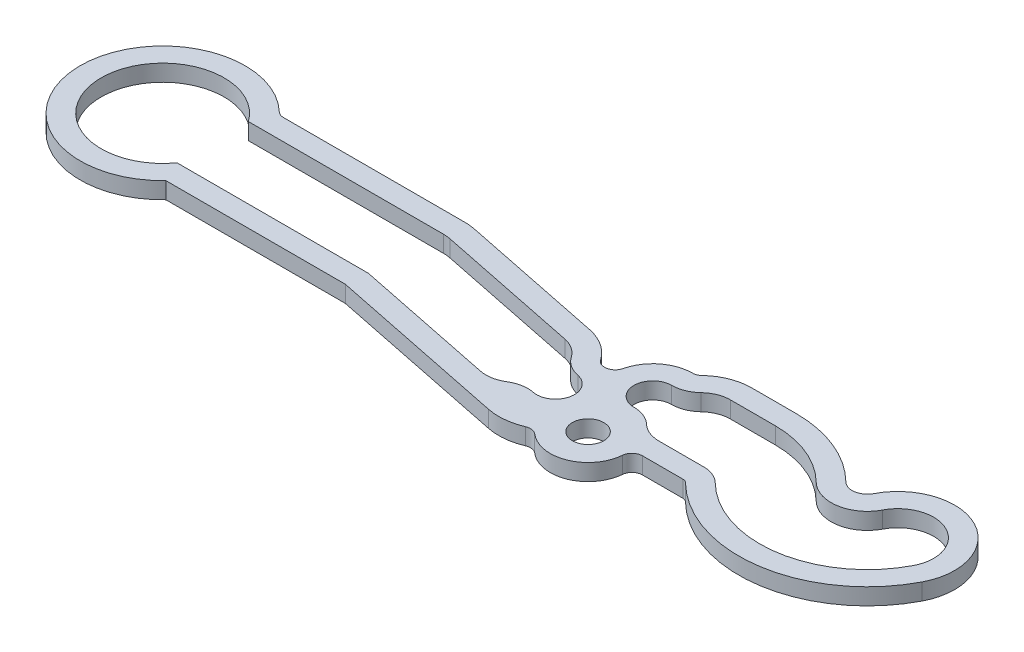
ISO-10303-21;
HEADER;
FILE_DESCRIPTION(('STEP AP214'),'2;1');
FILE_NAME('part.step','',(''),(''),'','','');
FILE_SCHEMA(('AUTOMOTIVE_DESIGN { 1 0 10303 214 1 1 1 1 }'));
ENDSEC;
DATA;
#1=APPLICATION_CONTEXT('core data for automotive mechanical design processes');
#2=APPLICATION_PROTOCOL_DEFINITION('international standard','automotive_design',2000,#1);
#3=PRODUCT_CONTEXT('',#1,'mechanical');
#4=PRODUCT('Part','Part','',(#3));
#5=PRODUCT_RELATED_PRODUCT_CATEGORY('part','',(#4));
#6=PRODUCT_DEFINITION_FORMATION('','',#4);
#7=PRODUCT_DEFINITION_CONTEXT('part definition',#1,'design');
#8=PRODUCT_DEFINITION('design','',#6,#7);
#9=PRODUCT_DEFINITION_SHAPE('','',#8);
#10=(LENGTH_UNIT() NAMED_UNIT(*) SI_UNIT(.MILLI.,.METRE.));
#11=(NAMED_UNIT(*) PLANE_ANGLE_UNIT() SI_UNIT($,.RADIAN.));
#12=(NAMED_UNIT(*) SI_UNIT($,.STERADIAN.) SOLID_ANGLE_UNIT());
#13=UNCERTAINTY_MEASURE_WITH_UNIT(LENGTH_MEASURE(1.E-05),#10,'distance_accuracy_value','');
#14=(GEOMETRIC_REPRESENTATION_CONTEXT(3) GLOBAL_UNCERTAINTY_ASSIGNED_CONTEXT((#13)) GLOBAL_UNIT_ASSIGNED_CONTEXT((#10,
#11,#12)) REPRESENTATION_CONTEXT('',''));
#15=CARTESIAN_POINT('',(0.,0.,0.));
#16=DIRECTION('',(0.,0.,1.));
#17=DIRECTION('',(1.,0.,0.));
#18=AXIS2_PLACEMENT_3D('',#15,#16,#17);
#19=CARTESIAN_POINT('',(36.2500000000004,-51.41,3.));
#20=DIRECTION('',(0.,-1.,0.));
#21=DIRECTION('',(0.,0.,-1.));
#22=AXIS2_PLACEMENT_3D('',#19,#20,#21);
#23=CYLINDRICAL_SURFACE('',#22,1.8);
#24=CARTESIAN_POINT('',(36.2500000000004,-51.41,3.));
#25=DIRECTION('',(0.,-1.,0.));
#26=DIRECTION('',(0.,0.,-1.));
#27=AXIS2_PLACEMENT_3D('',#24,#25,#26);
#28=CIRCLE('',#27,1.8);
#29=CARTESIAN_POINT('',(38.0431817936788,-51.41,3.15652173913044));
#30=VERTEX_POINT('',#29);
#31=CARTESIAN_POINT('',(35.0774277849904,-51.41,4.36567726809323));
#32=VERTEX_POINT('',#31);
#33=EDGE_CURVE('E548',#30,#32,#28,.T.);
#34=ORIENTED_EDGE('',*,*,#33,.T.);
#35=DIRECTION('',(0.,-1.,0.));
#36=VECTOR('',#35,1.);
#37=CARTESIAN_POINT('',(35.0774277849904,-51.41,4.36567726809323));
#38=LINE('',#37,#36);
#39=CARTESIAN_POINT('',(35.0774277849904,-52.2,4.36567726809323));
#40=VERTEX_POINT('',#39);
#41=EDGE_CURVE('E715',#32,#40,#38,.T.);
#42=ORIENTED_EDGE('',*,*,#41,.T.);
#43=CARTESIAN_POINT('',(36.2500000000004,-52.2,3.));
#44=DIRECTION('',(0.,-1.,0.));
#45=DIRECTION('',(0.,0.,-1.));
#46=AXIS2_PLACEMENT_3D('',#43,#44,#45);
#47=CIRCLE('',#46,1.8);
#48=CARTESIAN_POINT('',(38.0431817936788,-52.2,3.15652173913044));
#49=VERTEX_POINT('',#48);
#50=EDGE_CURVE('E545',#49,#40,#47,.T.);
#51=ORIENTED_EDGE('',*,*,#50,.F.);
#52=DIRECTION('',(0.,-1.,0.));
#53=VECTOR('',#52,1.);
#54=CARTESIAN_POINT('',(38.0431817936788,-51.41,3.15652173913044));
#55=LINE('',#54,#53);
#56=EDGE_CURVE('E713',#49,#30,#55,.F.);
#57=ORIENTED_EDGE('',*,*,#56,.T.);
#58=EDGE_LOOP('',(#34,#42,#51,#57));
#59=FACE_BOUND('',#58,.T.);
#60=ADVANCED_FACE('F41',(#59),#23,.T.);
#61=CARTESIAN_POINT('',(38.0248239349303,-51.41,2.7));
#62=DIRECTION('',(0.,0.,1.));
#63=DIRECTION('',(1.,0.,0.));
#64=AXIS2_PLACEMENT_3D('',#61,#62,#63);
#65=PLANE('',#64);
#66=DIRECTION('',(-1.,0.,0.));
#67=VECTOR('',#66,1.);
#68=CARTESIAN_POINT('',(38.0248239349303,-51.41,2.7));
#69=LINE('',#68,#67);
#70=CARTESIAN_POINT('',(40.4630701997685,-51.41,2.7));
#71=VERTEX_POINT('',#70);
#72=CARTESIAN_POINT('',(38.5412878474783,-51.41,2.7));
#73=VERTEX_POINT('',#72);
#74=EDGE_CURVE('E606',#71,#73,#69,.T.);
#75=ORIENTED_EDGE('',*,*,#74,.T.);
#76=DIRECTION('',(0.,1.,0.));
#77=VECTOR('',#76,1.);
#78=CARTESIAN_POINT('',(38.5412878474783,-52.2,2.7));
#79=LINE('',#78,#77);
#80=CARTESIAN_POINT('',(38.5412878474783,-52.2,2.7));
#81=VERTEX_POINT('',#80);
#82=EDGE_CURVE('E720',#73,#81,#79,.F.);
#83=ORIENTED_EDGE('',*,*,#82,.T.);
#84=DIRECTION('',(-1.,0.,0.));
#85=VECTOR('',#84,1.);
#86=CARTESIAN_POINT('',(38.0248239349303,-52.2,2.7));
#87=LINE('',#86,#85);
#88=CARTESIAN_POINT('',(40.4630701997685,-52.2,2.7));
#89=VERTEX_POINT('',#88);
#90=EDGE_CURVE('E552',#89,#81,#87,.T.);
#91=ORIENTED_EDGE('',*,*,#90,.F.);
#92=DIRECTION('',(0.,-1.,0.));
#93=VECTOR('',#92,1.);
#94=CARTESIAN_POINT('',(40.4630701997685,-51.41,2.7));
#95=LINE('',#94,#93);
#96=EDGE_CURVE('E667',#71,#89,#95,.T.);
#97=ORIENTED_EDGE('',*,*,#96,.F.);
#98=EDGE_LOOP('',(#75,#83,#91,#97));
#99=FACE_BOUND('',#98,.T.);
#100=ADVANCED_FACE('F740',(#99),#65,.T.);
#101=CARTESIAN_POINT('',(40.4630701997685,-51.41,3.));
#102=DIRECTION('',(0.,-1.,0.));
#103=DIRECTION('',(0.,0.,-1.));
#104=AXIS2_PLACEMENT_3D('',#101,#102,#103);
#105=CYLINDRICAL_SURFACE('',#104,0.3);
#106=CARTESIAN_POINT('',(40.4630701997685,-52.2,3.));
#107=DIRECTION('',(0.,1.,0.));
#108=DIRECTION('',(0.,0.,-1.));
#109=AXIS2_PLACEMENT_3D('',#106,#107,#108);
#110=CIRCLE('',#109,0.3);
#111=CARTESIAN_POINT('',(40.6733776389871,-52.2,2.78605893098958));
#112=VERTEX_POINT('',#111);
#113=EDGE_CURVE('E662',#112,#89,#110,.T.);
#114=ORIENTED_EDGE('',*,*,#113,.F.);
#115=DIRECTION('',(0.,-1.,0.));
#116=VECTOR('',#115,1.);
#117=CARTESIAN_POINT('',(40.6733776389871,-51.41,2.78605893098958));
#118=LINE('',#117,#116);
#119=CARTESIAN_POINT('',(40.6733776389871,-51.41,2.78605893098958));
#120=VERTEX_POINT('',#119);
#121=EDGE_CURVE('E670',#120,#112,#118,.T.);
#122=ORIENTED_EDGE('',*,*,#121,.F.);
#123=CARTESIAN_POINT('',(40.4630701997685,-51.41,3.));
#124=DIRECTION('',(0.,1.,0.));
#125=DIRECTION('',(0.,0.,-1.));
#126=AXIS2_PLACEMENT_3D('',#123,#124,#125);
#127=CIRCLE('',#126,0.3);
#128=EDGE_CURVE('E603',#120,#71,#127,.T.);
#129=ORIENTED_EDGE('',*,*,#128,.T.);
#130=ORIENTED_EDGE('',*,*,#96,.T.);
#131=EDGE_LOOP('',(#114,#122,#129,#130));
#132=FACE_BOUND('',#131,.T.);
#133=ADVANCED_FACE('F844',(#132),#105,.F.);
#134=CARTESIAN_POINT('',(44.9647730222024,-51.41,-1.57948191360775));
#135=DIRECTION('',(0.,-1.,0.));
#136=DIRECTION('',(0.,0.,-1.));
#137=AXIS2_PLACEMENT_3D('',#134,#135,#136);
#138=CYLINDRICAL_SURFACE('',#137,6.1216028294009);
#139=CARTESIAN_POINT('',(44.9647730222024,-52.2,-1.57948191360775));
#140=DIRECTION('',(0.,-1.,0.));
#141=DIRECTION('',(0.,0.,-1.));
#142=AXIS2_PLACEMENT_3D('',#139,#140,#141);
#143=CIRCLE('',#142,6.1216028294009);
#144=CARTESIAN_POINT('',(50.3951093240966,-52.2,1.24637527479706));
#145=VERTEX_POINT('',#144);
#146=EDGE_CURVE('E659',#145,#112,#143,.T.);
#147=ORIENTED_EDGE('',*,*,#146,.F.);
#148=DIRECTION('',(0.,-1.,0.));
#149=VECTOR('',#148,1.);
#150=CARTESIAN_POINT('',(50.3951093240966,-51.41,1.24637527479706));
#151=LINE('',#150,#149);
#152=CARTESIAN_POINT('',(50.3951093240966,-51.41,1.24637527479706));
#153=VERTEX_POINT('',#152);
#154=EDGE_CURVE('E672',#153,#145,#151,.T.);
#155=ORIENTED_EDGE('',*,*,#154,.F.);
#156=CARTESIAN_POINT('',(44.9647730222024,-51.41,-1.57948191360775));
#157=DIRECTION('',(0.,-1.,0.));
#158=DIRECTION('',(0.,0.,-1.));
#159=AXIS2_PLACEMENT_3D('',#156,#157,#158);
#160=CIRCLE('',#159,6.1216028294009);
#161=EDGE_CURVE('E600',#153,#120,#160,.T.);
#162=ORIENTED_EDGE('',*,*,#161,.T.);
#163=ORIENTED_EDGE('',*,*,#121,.T.);
#164=EDGE_LOOP('',(#147,#155,#162,#163));
#165=FACE_BOUND('',#164,.T.);
#166=ADVANCED_FACE('F747',(#165),#138,.T.);
#167=CARTESIAN_POINT('',(48.,-51.41,0.));
#168=DIRECTION('',(0.,-1.,0.));
#169=DIRECTION('',(0.,0.,-1.));
#170=AXIS2_PLACEMENT_3D('',#167,#168,#169);
#171=CYLINDRICAL_SURFACE('',#170,2.7);
#172=CARTESIAN_POINT('',(48.,-52.2,0.));
#173=DIRECTION('',(0.,-1.,0.));
#174=DIRECTION('',(0.,0.,-1.));
#175=AXIS2_PLACEMENT_3D('',#172,#173,#174);
#176=CIRCLE('',#175,2.7);
#177=CARTESIAN_POINT('',(45.6048906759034,-52.2,-1.24637527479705));
#178=VERTEX_POINT('',#177);
#179=EDGE_CURVE('E656',#178,#145,#176,.T.);
#180=ORIENTED_EDGE('',*,*,#179,.F.);
#181=DIRECTION('',(0.,-1.,0.));
#182=VECTOR('',#181,1.);
#183=CARTESIAN_POINT('',(45.6048906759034,-51.41,-1.24637527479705));
#184=LINE('',#183,#182);
#185=CARTESIAN_POINT('',(45.6048906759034,-51.41,-1.24637527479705));
#186=VERTEX_POINT('',#185);
#187=EDGE_CURVE('E674',#186,#178,#184,.T.);
#188=ORIENTED_EDGE('',*,*,#187,.F.);
#189=CARTESIAN_POINT('',(48.,-51.41,0.));
#190=DIRECTION('',(0.,-1.,0.));
#191=DIRECTION('',(0.,0.,-1.));
#192=AXIS2_PLACEMENT_3D('',#189,#190,#191);
#193=CIRCLE('',#192,2.7);
#194=EDGE_CURVE('E597',#186,#153,#193,.T.);
#195=ORIENTED_EDGE('',*,*,#194,.T.);
#196=ORIENTED_EDGE('',*,*,#154,.T.);
#197=EDGE_LOOP('',(#180,#188,#195,#196));
#198=FACE_BOUND('',#197,.T.);
#199=ADVANCED_FACE('F751',(#198),#171,.T.);
#200=CARTESIAN_POINT('',(44.9647730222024,-51.41,-1.57948191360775));
#201=DIRECTION('',(0.,-1.,0.));
#202=DIRECTION('',(0.,0.,-1.));
#203=AXIS2_PLACEMENT_3D('',#200,#201,#202);
#204=CYLINDRICAL_SURFACE('',#203,0.721602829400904);
#205=CARTESIAN_POINT('',(44.9647730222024,-52.2,-1.57948191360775));
#206=DIRECTION('',(0.,1.,0.));
#207=DIRECTION('',(0.,0.,-1.));
#208=AXIS2_PLACEMENT_3D('',#205,#206,#207);
#209=CIRCLE('',#208,0.721602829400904);
#210=CARTESIAN_POINT('',(44.4589115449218,-52.2,-1.06488031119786));
#211=VERTEX_POINT('',#210);
#212=EDGE_CURVE('E653',#211,#178,#209,.T.);
#213=ORIENTED_EDGE('',*,*,#212,.F.);
#214=DIRECTION('',(0.,-1.,0.));
#215=VECTOR('',#214,1.);
#216=CARTESIAN_POINT('',(44.4589115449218,-51.41,-1.06488031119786));
#217=LINE('',#216,#215);
#218=CARTESIAN_POINT('',(44.4589115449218,-51.41,-1.06488031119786));
#219=VERTEX_POINT('',#218);
#220=EDGE_CURVE('E676',#219,#211,#217,.T.);
#221=ORIENTED_EDGE('',*,*,#220,.F.);
#222=CARTESIAN_POINT('',(44.9647730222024,-51.41,-1.57948191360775));
#223=DIRECTION('',(0.,1.,0.));
#224=DIRECTION('',(0.,0.,-1.));
#225=AXIS2_PLACEMENT_3D('',#222,#223,#224);
#226=CIRCLE('',#225,0.721602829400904);
#227=EDGE_CURVE('E594',#219,#186,#226,.T.);
#228=ORIENTED_EDGE('',*,*,#227,.T.);
#229=ORIENTED_EDGE('',*,*,#187,.T.);
#230=EDGE_LOOP('',(#213,#221,#228,#229));
#231=FACE_BOUND('',#230,.T.);
#232=ADVANCED_FACE('F756',(#231),#204,.F.);
#233=CARTESIAN_POINT('',(40.4630701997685,-51.41,3.));
#234=DIRECTION('',(0.,-1.,0.));
#235=DIRECTION('',(0.,0.,-1.));
#236=AXIS2_PLACEMENT_3D('',#233,#234,#235);
#237=CYLINDRICAL_SURFACE('',#236,5.7);
#238=CARTESIAN_POINT('',(40.4630701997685,-52.2,3.));
#239=DIRECTION('',(0.,-1.,0.));
#240=DIRECTION('',(0.,0.,-1.));
#241=AXIS2_PLACEMENT_3D('',#238,#239,#240);
#242=CIRCLE('',#241,5.7);
#243=CARTESIAN_POINT('',(40.4630701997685,-52.2,-2.69999999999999));
#244=VERTEX_POINT('',#243);
#245=EDGE_CURVE('E650',#244,#211,#242,.T.);
#246=ORIENTED_EDGE('',*,*,#245,.F.);
#247=DIRECTION('',(0.,-1.,0.));
#248=VECTOR('',#247,1.);
#249=CARTESIAN_POINT('',(40.4630701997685,-51.41,-2.69999999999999));
#250=LINE('',#249,#248);
#251=CARTESIAN_POINT('',(40.4630701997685,-51.41,-2.69999999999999));
#252=VERTEX_POINT('',#251);
#253=EDGE_CURVE('E678',#252,#244,#250,.T.);
#254=ORIENTED_EDGE('',*,*,#253,.F.);
#255=CARTESIAN_POINT('',(40.4630701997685,-51.41,3.));
#256=DIRECTION('',(0.,-1.,0.));
#257=DIRECTION('',(0.,0.,-1.));
#258=AXIS2_PLACEMENT_3D('',#255,#256,#257);
#259=CIRCLE('',#258,5.7);
#260=EDGE_CURVE('E591',#252,#219,#259,.T.);
#261=ORIENTED_EDGE('',*,*,#260,.T.);
#262=ORIENTED_EDGE('',*,*,#220,.T.);
#263=EDGE_LOOP('',(#246,#254,#261,#262));
#264=FACE_BOUND('',#263,.T.);
#265=ADVANCED_FACE('F759',(#264),#237,.T.);
#266=CARTESIAN_POINT('',(40.4630701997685,-51.41,-2.69999999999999));
#267=DIRECTION('',(0.,0.,-1.));
#268=DIRECTION('',(-1.,0.,0.));
#269=AXIS2_PLACEMENT_3D('',#266,#267,#268);
#270=PLANE('',#269);
#271=DIRECTION('',(1.,0.,0.));
#272=VECTOR('',#271,1.);
#273=CARTESIAN_POINT('',(40.4630701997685,-52.2,-2.69999999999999));
#274=LINE('',#273,#272);
#275=CARTESIAN_POINT('',(38.3333333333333,-52.2,-2.69999999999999));
#276=VERTEX_POINT('',#275);
#277=EDGE_CURVE('E647',#276,#244,#274,.T.);
#278=ORIENTED_EDGE('',*,*,#277,.F.);
#279=DIRECTION('',(0.,-1.,0.));
#280=VECTOR('',#279,1.);
#281=CARTESIAN_POINT('',(38.3333333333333,-51.41,-2.69999999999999));
#282=LINE('',#281,#280);
#283=CARTESIAN_POINT('',(38.3333333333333,-51.41,-2.69999999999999));
#284=VERTEX_POINT('',#283);
#285=EDGE_CURVE('E680',#284,#276,#282,.T.);
#286=ORIENTED_EDGE('',*,*,#285,.F.);
#287=DIRECTION('',(1.,0.,0.));
#288=VECTOR('',#287,1.);
#289=CARTESIAN_POINT('',(40.4630701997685,-51.41,-2.69999999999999));
#290=LINE('',#289,#288);
#291=EDGE_CURVE('E588',#284,#252,#290,.T.);
#292=ORIENTED_EDGE('',*,*,#291,.T.);
#293=ORIENTED_EDGE('',*,*,#253,.T.);
#294=EDGE_LOOP('',(#278,#286,#292,#293));
#295=FACE_BOUND('',#294,.T.);
#296=ADVANCED_FACE('F764',(#295),#270,.T.);
#297=CARTESIAN_POINT('',(38.3333333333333,-51.41,-0.25));
#298=DIRECTION('',(0.,-1.,0.));
#299=DIRECTION('',(0.,0.,-1.));
#300=AXIS2_PLACEMENT_3D('',#297,#298,#299);
#301=CYLINDRICAL_SURFACE('',#300,2.45);
#302=CARTESIAN_POINT('',(38.3333333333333,-52.2,-0.25));
#303=DIRECTION('',(0.,-1.,0.));
#304=DIRECTION('',(0.,0.,-1.));
#305=AXIS2_PLACEMENT_3D('',#302,#303,#304);
#306=CIRCLE('',#305,2.45);
#307=CARTESIAN_POINT('',(36.6436781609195,-52.2,-2.02413793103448));
#308=VERTEX_POINT('',#307);
#309=EDGE_CURVE('E644',#308,#276,#306,.T.);
#310=ORIENTED_EDGE('',*,*,#309,.F.);
#311=DIRECTION('',(0.,-1.,0.));
#312=VECTOR('',#311,1.);
#313=CARTESIAN_POINT('',(36.6436781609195,-51.41,-2.02413793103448));
#314=LINE('',#313,#312);
#315=CARTESIAN_POINT('',(36.6436781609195,-51.41,-2.02413793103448));
#316=VERTEX_POINT('',#315);
#317=EDGE_CURVE('E682',#316,#308,#314,.T.);
#318=ORIENTED_EDGE('',*,*,#317,.F.);
#319=CARTESIAN_POINT('',(38.3333333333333,-51.41,-0.25));
#320=DIRECTION('',(0.,-1.,0.));
#321=DIRECTION('',(0.,0.,-1.));
#322=AXIS2_PLACEMENT_3D('',#319,#320,#321);
#323=CIRCLE('',#322,2.45);
#324=EDGE_CURVE('E585',#316,#284,#323,.T.);
#325=ORIENTED_EDGE('',*,*,#324,.T.);
#326=ORIENTED_EDGE('',*,*,#285,.T.);
#327=EDGE_LOOP('',(#310,#318,#325,#326));
#328=FACE_BOUND('',#327,.T.);
#329=ADVANCED_FACE('F767',(#328),#301,.T.);
#330=CARTESIAN_POINT('',(36.3333333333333,-51.41,-2.35));
#331=DIRECTION('',(0.,-1.,0.));
#332=DIRECTION('',(0.,0.,-1.));
#333=AXIS2_PLACEMENT_3D('',#330,#331,#332);
#334=CYLINDRICAL_SURFACE('',#333,0.449999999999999);
#335=CARTESIAN_POINT('',(36.3333333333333,-52.2,-2.35));
#336=DIRECTION('',(0.,1.,0.));
#337=DIRECTION('',(0.,0.,1.));
#338=AXIS2_PLACEMENT_3D('',#335,#336,#337);
#339=CIRCLE('',#338,0.449999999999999);
#340=CARTESIAN_POINT('',(36.3333333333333,-52.2,-1.9));
#341=VERTEX_POINT('',#340);
#342=EDGE_CURVE('E641',#341,#308,#339,.T.);
#343=ORIENTED_EDGE('',*,*,#342,.F.);
#344=DIRECTION('',(0.,-1.,0.));
#345=VECTOR('',#344,1.);
#346=CARTESIAN_POINT('',(36.3333333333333,-51.41,-1.9));
#347=LINE('',#346,#345);
#348=CARTESIAN_POINT('',(36.3333333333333,-51.41,-1.9));
#349=VERTEX_POINT('',#348);
#350=EDGE_CURVE('E684',#349,#341,#347,.T.);
#351=ORIENTED_EDGE('',*,*,#350,.F.);
#352=CARTESIAN_POINT('',(36.3333333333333,-51.41,-2.35));
#353=DIRECTION('',(0.,1.,0.));
#354=DIRECTION('',(0.,0.,1.));
#355=AXIS2_PLACEMENT_3D('',#352,#353,#354);
#356=CIRCLE('',#355,0.449999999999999);
#357=EDGE_CURVE('E582',#349,#316,#356,.T.);
#358=ORIENTED_EDGE('',*,*,#357,.T.);
#359=ORIENTED_EDGE('',*,*,#317,.T.);
#360=EDGE_LOOP('',(#343,#351,#358,#359));
#361=FACE_BOUND('',#360,.T.);
#362=ADVANCED_FACE('F773',(#361),#334,.F.);
#363=CARTESIAN_POINT('',(36.3333333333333,-51.41,0.));
#364=DIRECTION('',(0.,-1.,0.));
#365=DIRECTION('',(0.,0.,-1.));
#366=AXIS2_PLACEMENT_3D('',#363,#364,#365);
#367=CYLINDRICAL_SURFACE('',#366,1.9);
#368=CARTESIAN_POINT('',(36.3333333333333,-52.2,0.));
#369=DIRECTION('',(0.,-1.,0.));
#370=DIRECTION('',(0.,0.,-1.));
#371=AXIS2_PLACEMENT_3D('',#368,#369,#370);
#372=CIRCLE('',#371,1.9);
#373=CARTESIAN_POINT('',(34.4835313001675,-52.2,-0.433857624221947));
#374=VERTEX_POINT('',#373);
#375=EDGE_CURVE('E639',#374,#341,#372,.T.);
#376=ORIENTED_EDGE('',*,*,#375,.F.);
#377=DIRECTION('',(0.,-1.,0.));
#378=VECTOR('',#377,1.);
#379=CARTESIAN_POINT('',(34.4835313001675,-51.41,-0.433857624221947));
#380=LINE('',#379,#378);
#381=CARTESIAN_POINT('',(34.4835313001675,-51.41,-0.433857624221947));
#382=VERTEX_POINT('',#381);
#383=EDGE_CURVE('E706',#374,#382,#380,.F.);
#384=ORIENTED_EDGE('',*,*,#383,.T.);
#385=CARTESIAN_POINT('',(36.3333333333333,-51.41,0.));
#386=DIRECTION('',(0.,-1.,0.));
#387=DIRECTION('',(0.,0.,-1.));
#388=AXIS2_PLACEMENT_3D('',#385,#386,#387);
#389=CIRCLE('',#388,1.9);
#390=EDGE_CURVE('E580',#382,#349,#389,.T.);
#391=ORIENTED_EDGE('',*,*,#390,.T.);
#392=ORIENTED_EDGE('',*,*,#350,.T.);
#393=EDGE_LOOP('',(#376,#384,#391,#392));
#394=FACE_BOUND('',#393,.T.);
#395=ADVANCED_FACE('F776',(#394),#367,.T.);
#396=CARTESIAN_POINT('',(33.5,-51.41,1.8));
#397=DIRECTION('',(0.,-1.,0.));
#398=DIRECTION('',(0.,0.,-1.));
#399=AXIS2_PLACEMENT_3D('',#396,#397,#398);
#400=CYLINDRICAL_SURFACE('',#399,1.9);
#401=CARTESIAN_POINT('',(33.5,-51.41,1.8));
#402=DIRECTION('',(0.,-1.,0.));
#403=DIRECTION('',(0.,0.,-1.));
#404=AXIS2_PLACEMENT_3D('',#401,#402,#403);
#405=CIRCLE('',#404,1.9);
#406=CARTESIAN_POINT('',(33.8793734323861,-51.41,-0.0617399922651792));
#407=VERTEX_POINT('',#406);
#408=CARTESIAN_POINT('',(33.8932535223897,-51.41,-0.0588576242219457));
#409=VERTEX_POINT('',#408);
#410=EDGE_CURVE('E577',#407,#409,#405,.T.);
#411=ORIENTED_EDGE('',*,*,#410,.T.);
#412=DIRECTION('',(0.,-1.,0.));
#413=VECTOR('',#412,1.);
#414=CARTESIAN_POINT('',(33.8932535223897,-51.41,-0.0588576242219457));
#415=LINE('',#414,#413);
#416=CARTESIAN_POINT('',(33.8932535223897,-52.2,-0.0588576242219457));
#417=VERTEX_POINT('',#416);
#418=EDGE_CURVE('E669',#409,#417,#415,.T.);
#419=ORIENTED_EDGE('',*,*,#418,.T.);
#420=CARTESIAN_POINT('',(33.5,-52.2,1.8));
#421=DIRECTION('',(0.,-1.,0.));
#422=DIRECTION('',(0.,0.,-1.));
#423=AXIS2_PLACEMENT_3D('',#420,#421,#422);
#424=CIRCLE('',#423,1.9);
#425=CARTESIAN_POINT('',(33.8793734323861,-52.2,-0.0617399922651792));
#426=VERTEX_POINT('',#425);
#427=EDGE_CURVE('E636',#426,#417,#424,.T.);
#428=ORIENTED_EDGE('',*,*,#427,.F.);
#429=DIRECTION('',(0.,-1.,0.));
#430=VECTOR('',#429,1.);
#431=CARTESIAN_POINT('',(33.8793734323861,-51.41,-0.0617399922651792));
#432=LINE('',#431,#430);
#433=EDGE_CURVE('E687',#407,#426,#432,.T.);
#434=ORIENTED_EDGE('',*,*,#433,.F.);
#435=EDGE_LOOP('',(#411,#419,#428,#434));
#436=FACE_BOUND('',#435,.T.);
#437=ADVANCED_FACE('F785',(#436),#400,.T.);
#438=CARTESIAN_POINT('',(33.9692250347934,-51.41,-0.502678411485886));
#439=DIRECTION('',(0.,-1.,0.));
#440=DIRECTION('',(0.,0.,-1.));
#441=AXIS2_PLACEMENT_3D('',#438,#439,#440);
#442=CYLINDRICAL_SURFACE('',#441,0.450000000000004);
#443=CARTESIAN_POINT('',(33.9692250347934,-52.2,-0.502678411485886));
#444=DIRECTION('',(0.,1.,0.));
#445=DIRECTION('',(0.,0.,-1.));
#446=AXIS2_PLACEMENT_3D('',#443,#444,#445);
#447=CIRCLE('',#446,0.450000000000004);
#448=CARTESIAN_POINT('',(33.6000646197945,-52.2,-0.245344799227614));
#449=VERTEX_POINT('',#448);
#450=EDGE_CURVE('E633',#449,#426,#447,.T.);
#451=ORIENTED_EDGE('',*,*,#450,.F.);
#452=DIRECTION('',(0.,-1.,0.));
#453=VECTOR('',#452,1.);
#454=CARTESIAN_POINT('',(33.6000646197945,-51.41,-0.245344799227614));
#455=LINE('',#454,#453);
#456=CARTESIAN_POINT('',(33.6000646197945,-51.41,-0.245344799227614));
#457=VERTEX_POINT('',#456);
#458=EDGE_CURVE('E689',#457,#449,#455,.T.);
#459=ORIENTED_EDGE('',*,*,#458,.F.);
#460=CARTESIAN_POINT('',(33.9692250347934,-51.41,-0.502678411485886));
#461=DIRECTION('',(0.,1.,0.));
#462=DIRECTION('',(0.,0.,-1.));
#463=AXIS2_PLACEMENT_3D('',#460,#461,#462);
#464=CIRCLE('',#463,0.450000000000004);
#465=EDGE_CURVE('E574',#457,#407,#464,.T.);
#466=ORIENTED_EDGE('',*,*,#465,.T.);
#467=ORIENTED_EDGE('',*,*,#433,.T.);
#468=EDGE_LOOP('',(#451,#459,#466,#467));
#469=FACE_BOUND('',#468,.T.);
#470=ADVANCED_FACE('F789',(#469),#442,.F.);
#471=CARTESIAN_POINT('',(31.5901912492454,-51.41,1.15569375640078));
#472=DIRECTION('',(0.,-1.,0.));
#473=DIRECTION('',(0.,0.,-1.));
#474=AXIS2_PLACEMENT_3D('',#471,#472,#473);
#475=CYLINDRICAL_SURFACE('',#474,2.45);
#476=CARTESIAN_POINT('',(31.5901912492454,-52.2,1.15569375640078));
#477=DIRECTION('',(0.,-1.,0.));
#478=DIRECTION('',(0.,0.,1.));
#479=AXIS2_PLACEMENT_3D('',#476,#477,#478);
#480=CIRCLE('',#479,2.45);
#481=CARTESIAN_POINT('',(32.0793833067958,-52.2,-1.24497097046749));
#482=VERTEX_POINT('',#481);
#483=EDGE_CURVE('E630',#482,#449,#480,.T.);
#484=ORIENTED_EDGE('',*,*,#483,.F.);
#485=DIRECTION('',(0.,-1.,0.));
#486=VECTOR('',#485,1.);
#487=CARTESIAN_POINT('',(32.0793833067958,-51.41,-1.24497097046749));
#488=LINE('',#487,#486);
#489=CARTESIAN_POINT('',(32.0793833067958,-51.41,-1.24497097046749));
#490=VERTEX_POINT('',#489);
#491=EDGE_CURVE('E691',#490,#482,#488,.T.);
#492=ORIENTED_EDGE('',*,*,#491,.F.);
#493=CARTESIAN_POINT('',(31.5901912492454,-51.41,1.15569375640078));
#494=DIRECTION('',(0.,-1.,0.));
#495=DIRECTION('',(0.,0.,1.));
#496=AXIS2_PLACEMENT_3D('',#493,#494,#495);
#497=CIRCLE('',#496,2.45);
#498=EDGE_CURVE('E571',#490,#457,#497,.T.);
#499=ORIENTED_EDGE('',*,*,#498,.T.);
#500=ORIENTED_EDGE('',*,*,#458,.T.);
#501=EDGE_LOOP('',(#484,#492,#499,#500));
#502=FACE_BOUND('',#501,.T.);
#503=ADVANCED_FACE('F794',(#502),#475,.T.);
#504=CARTESIAN_POINT('',(32.0793833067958,-51.41,-1.24497097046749));
#505=DIRECTION('',(0.199670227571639,0.,-0.979863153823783));
#506=DIRECTION('',(-0.979863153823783,0.,-0.199670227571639));
#507=AXIS2_PLACEMENT_3D('',#504,#505,#506);
#508=PLANE('',#507);
#509=DIRECTION('',(0.979863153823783,0.,0.199670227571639));
#510=VECTOR('',#509,1.);
#511=CARTESIAN_POINT('',(32.0793833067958,-52.2,-1.24497097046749));
#512=LINE('',#511,#510);
#513=CARTESIAN_POINT('',(25.2057762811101,-52.2,-2.64563051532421));
#514=VERTEX_POINT('',#513);
#515=EDGE_CURVE('E627',#514,#482,#512,.T.);
#516=ORIENTED_EDGE('',*,*,#515,.F.);
#517=DIRECTION('',(0.,-1.,0.));
#518=VECTOR('',#517,1.);
#519=CARTESIAN_POINT('',(25.2057762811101,-51.41,-2.64563051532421));
#520=LINE('',#519,#518);
#521=CARTESIAN_POINT('',(25.2057762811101,-51.41,-2.64563051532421));
#522=VERTEX_POINT('',#521);
#523=EDGE_CURVE('E693',#522,#514,#520,.T.);
#524=ORIENTED_EDGE('',*,*,#523,.F.);
#525=DIRECTION('',(0.979863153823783,0.,0.199670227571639));
#526=VECTOR('',#525,1.);
#527=CARTESIAN_POINT('',(32.0793833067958,-51.41,-1.24497097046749));
#528=LINE('',#527,#526);
#529=EDGE_CURVE('E568',#522,#490,#528,.T.);
#530=ORIENTED_EDGE('',*,*,#529,.T.);
#531=ORIENTED_EDGE('',*,*,#491,.T.);
#532=EDGE_LOOP('',(#516,#524,#530,#531));
#533=FACE_BOUND('',#532,.T.);
#534=ADVANCED_FACE('F797',(#533),#508,.T.);
#535=CARTESIAN_POINT('',(24.6666666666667,-51.41,0.));
#536=DIRECTION('',(0.,-1.,0.));
#537=DIRECTION('',(0.,0.,-1.));
#538=AXIS2_PLACEMENT_3D('',#535,#536,#537);
#539=CYLINDRICAL_SURFACE('',#538,2.7);
#540=CARTESIAN_POINT('',(24.6666666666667,-52.2,0.));
#541=DIRECTION('',(0.,-1.,0.));
#542=DIRECTION('',(0.,0.,-1.));
#543=AXIS2_PLACEMENT_3D('',#540,#541,#542);
#544=CIRCLE('',#543,2.7);
#545=CARTESIAN_POINT('',(24.6666666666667,-52.2,-2.7));
#546=VERTEX_POINT('',#545);
#547=EDGE_CURVE('E624',#546,#514,#544,.T.);
#548=ORIENTED_EDGE('',*,*,#547,.F.);
#549=DIRECTION('',(0.,-1.,0.));
#550=VECTOR('',#549,1.);
#551=CARTESIAN_POINT('',(24.6666666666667,-51.41,-2.7));
#552=LINE('',#551,#550);
#553=CARTESIAN_POINT('',(24.6666666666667,-51.41,-2.7));
#554=VERTEX_POINT('',#553);
#555=EDGE_CURVE('E695',#554,#546,#552,.T.);
#556=ORIENTED_EDGE('',*,*,#555,.F.);
#557=CARTESIAN_POINT('',(24.6666666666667,-51.41,0.));
#558=DIRECTION('',(0.,-1.,0.));
#559=DIRECTION('',(0.,0.,-1.));
#560=AXIS2_PLACEMENT_3D('',#557,#558,#559);
#561=CIRCLE('',#560,2.7);
#562=EDGE_CURVE('E565',#554,#522,#561,.T.);
#563=ORIENTED_EDGE('',*,*,#562,.T.);
#564=ORIENTED_EDGE('',*,*,#523,.T.);
#565=EDGE_LOOP('',(#548,#556,#563,#564));
#566=FACE_BOUND('',#565,.T.);
#567=ADVANCED_FACE('F803',(#566),#539,.T.);
#568=CARTESIAN_POINT('',(15.8515485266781,-51.41,-2.7));
#569=DIRECTION('',(0.,0.,-1.));
#570=DIRECTION('',(-1.,0.,0.));
#571=AXIS2_PLACEMENT_3D('',#568,#569,#570);
#572=PLANE('',#571);
#573=DIRECTION('',(1.,0.,0.));
#574=VECTOR('',#573,1.);
#575=CARTESIAN_POINT('',(15.8515485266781,-52.2,-2.7));
#576=LINE('',#575,#574);
#577=CARTESIAN_POINT('',(16.0591386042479,-52.2,-2.7));
#578=VERTEX_POINT('',#577);
#579=EDGE_CURVE('E622',#578,#546,#576,.T.);
#580=ORIENTED_EDGE('',*,*,#579,.F.);
#581=DIRECTION('',(0.,1.,0.));
#582=VECTOR('',#581,1.);
#583=CARTESIAN_POINT('',(16.0591386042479,-51.41,-2.7));
#584=LINE('',#583,#582);
#585=CARTESIAN_POINT('',(16.0591386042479,-51.41,-2.7));
#586=VERTEX_POINT('',#585);
#587=EDGE_CURVE('E711',#578,#586,#584,.T.);
#588=ORIENTED_EDGE('',*,*,#587,.T.);
#589=DIRECTION('',(1.,0.,0.));
#590=VECTOR('',#589,1.);
#591=CARTESIAN_POINT('',(15.8515485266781,-51.41,-2.7));
#592=LINE('',#591,#590);
#593=EDGE_CURVE('E563',#586,#554,#592,.T.);
#594=ORIENTED_EDGE('',*,*,#593,.T.);
#595=ORIENTED_EDGE('',*,*,#555,.T.);
#596=EDGE_LOOP('',(#580,#588,#594,#595));
#597=FACE_BOUND('',#596,.T.);
#598=ADVANCED_FACE('F806',(#597),#572,.T.);
#599=CARTESIAN_POINT('',(13.,-51.41,0.));
#600=DIRECTION('',(0.,-1.,0.));
#601=DIRECTION('',(0.,0.,-1.));
#602=AXIS2_PLACEMENT_3D('',#599,#600,#601);
#603=CYLINDRICAL_SURFACE('',#602,3.927);
#604=CARTESIAN_POINT('',(13.,-51.41,0.));
#605=DIRECTION('',(0.,-1.,0.));
#606=DIRECTION('',(0.,0.,-1.));
#607=AXIS2_PLACEMENT_3D('',#604,#605,#606);
#608=CIRCLE('',#607,3.927);
#609=CARTESIAN_POINT('',(15.8515485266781,-51.41,2.69999999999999));
#610=VERTEX_POINT('',#609);
#611=CARTESIAN_POINT('',(15.7136293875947,-51.41,-2.83858143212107));
#612=VERTEX_POINT('',#611);
#613=EDGE_CURVE('E560',#610,#612,#608,.T.);
#614=ORIENTED_EDGE('',*,*,#613,.T.);
#615=DIRECTION('',(0.,-1.,0.));
#616=VECTOR('',#615,1.);
#617=CARTESIAN_POINT('',(15.7136293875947,-51.41,-2.83858143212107));
#618=LINE('',#617,#616);
#619=CARTESIAN_POINT('',(15.7136293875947,-52.2,-2.83858143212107));
#620=VERTEX_POINT('',#619);
#621=EDGE_CURVE('E708',#612,#620,#618,.T.);
#622=ORIENTED_EDGE('',*,*,#621,.T.);
#623=CARTESIAN_POINT('',(13.,-52.2,0.));
#624=DIRECTION('',(0.,-1.,0.));
#625=DIRECTION('',(0.,0.,-1.));
#626=AXIS2_PLACEMENT_3D('',#623,#624,#625);
#627=CIRCLE('',#626,3.927);
#628=CARTESIAN_POINT('',(15.8515485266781,-52.2,2.69999999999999));
#629=VERTEX_POINT('',#628);
#630=EDGE_CURVE('E619',#629,#620,#627,.T.);
#631=ORIENTED_EDGE('',*,*,#630,.F.);
#632=DIRECTION('',(0.,-1.,0.));
#633=VECTOR('',#632,1.);
#634=CARTESIAN_POINT('',(15.8515485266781,-51.41,2.69999999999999));
#635=LINE('',#634,#633);
#636=EDGE_CURVE('E698',#610,#629,#635,.T.);
#637=ORIENTED_EDGE('',*,*,#636,.F.);
#638=EDGE_LOOP('',(#614,#622,#631,#637));
#639=FACE_BOUND('',#638,.T.);
#640=ADVANCED_FACE('F815',(#639),#603,.T.);
#641=CARTESIAN_POINT('',(15.8515485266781,-51.41,2.69999999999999));
#642=DIRECTION('',(0.,0.,1.));
#643=DIRECTION('',(1.,0.,0.));
#644=AXIS2_PLACEMENT_3D('',#641,#642,#643);
#645=PLANE('',#644);
#646=DIRECTION('',(-1.,0.,0.));
#647=VECTOR('',#646,1.);
#648=CARTESIAN_POINT('',(15.8515485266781,-52.2,2.69999999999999));
#649=LINE('',#648,#647);
#650=CARTESIAN_POINT('',(24.3943702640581,-52.2,2.7));
#651=VERTEX_POINT('',#650);
#652=EDGE_CURVE('E616',#651,#629,#649,.T.);
#653=ORIENTED_EDGE('',*,*,#652,.F.);
#654=DIRECTION('',(0.,-1.,0.));
#655=VECTOR('',#654,1.);
#656=CARTESIAN_POINT('',(24.3943702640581,-51.41,2.7));
#657=LINE('',#656,#655);
#658=CARTESIAN_POINT('',(24.3943702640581,-51.41,2.7));
#659=VERTEX_POINT('',#658);
#660=EDGE_CURVE('E700',#659,#651,#657,.T.);
#661=ORIENTED_EDGE('',*,*,#660,.F.);
#662=DIRECTION('',(-1.,0.,0.));
#663=VECTOR('',#662,1.);
#664=CARTESIAN_POINT('',(15.8515485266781,-51.41,2.69999999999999));
#665=LINE('',#664,#663);
#666=EDGE_CURVE('E557',#659,#610,#665,.T.);
#667=ORIENTED_EDGE('',*,*,#666,.T.);
#668=ORIENTED_EDGE('',*,*,#636,.T.);
#669=EDGE_LOOP('',(#653,#661,#667,#668));
#670=FACE_BOUND('',#669,.T.);
#671=ADVANCED_FACE('F819',(#670),#645,.T.);
#672=CARTESIAN_POINT('',(24.3943702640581,-51.41,2.7));
#673=DIRECTION('',(-0.199670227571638,0.,0.979863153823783));
#674=DIRECTION('',(0.979863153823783,0.,0.199670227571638));
#675=AXIS2_PLACEMENT_3D('',#672,#673,#674);
#676=PLANE('',#675);
#677=DIRECTION('',(-0.979863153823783,0.,-0.199670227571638));
#678=VECTOR('',#677,1.);
#679=CARTESIAN_POINT('',(24.3943702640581,-52.2,2.7));
#680=LINE('',#679,#678);
#681=CARTESIAN_POINT('',(32.9608903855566,-52.2,4.44563051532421));
#682=VERTEX_POINT('',#681);
#683=EDGE_CURVE('E613',#682,#651,#680,.T.);
#684=ORIENTED_EDGE('',*,*,#683,.F.);
#685=DIRECTION('',(0.,-1.,0.));
#686=VECTOR('',#685,1.);
#687=CARTESIAN_POINT('',(32.9608903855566,-51.41,4.44563051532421));
#688=LINE('',#687,#686);
#689=CARTESIAN_POINT('',(32.9608903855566,-51.41,4.44563051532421));
#690=VERTEX_POINT('',#689);
#691=EDGE_CURVE('E608',#690,#682,#688,.T.);
#692=ORIENTED_EDGE('',*,*,#691,.F.);
#693=DIRECTION('',(-0.979863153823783,0.,-0.199670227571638));
#694=VECTOR('',#693,1.);
#695=CARTESIAN_POINT('',(24.3943702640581,-51.41,2.7));
#696=LINE('',#695,#694);
#697=EDGE_CURVE('E554',#690,#659,#696,.T.);
#698=ORIENTED_EDGE('',*,*,#697,.T.);
#699=ORIENTED_EDGE('',*,*,#660,.T.);
#700=EDGE_LOOP('',(#684,#692,#698,#699));
#701=FACE_BOUND('',#700,.T.);
#702=ADVANCED_FACE('F825',(#701),#676,.T.);
#703=CARTESIAN_POINT('',(33.5,-51.41,1.8));
#704=DIRECTION('',(0.,-1.,0.));
#705=DIRECTION('',(0.,0.,-1.));
#706=AXIS2_PLACEMENT_3D('',#703,#704,#705);
#707=CYLINDRICAL_SURFACE('',#706,2.7);
#708=CARTESIAN_POINT('',(33.5,-52.2,1.8));
#709=DIRECTION('',(0.,-1.,0.));
#710=DIRECTION('',(0.,0.,-1.));
#711=AXIS2_PLACEMENT_3D('',#708,#709,#710);
#712=CIRCLE('',#711,2.7);
#713=CARTESIAN_POINT('',(34.5561330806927,-52.2,4.28487080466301));
#714=VERTEX_POINT('',#713);
#715=EDGE_CURVE('E611',#714,#682,#712,.T.);
#716=ORIENTED_EDGE('',*,*,#715,.F.);
#717=DIRECTION('',(0.,-1.,0.));
#718=VECTOR('',#717,1.);
#719=CARTESIAN_POINT('',(34.5561330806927,-51.41,4.28487080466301));
#720=LINE('',#719,#718);
#721=CARTESIAN_POINT('',(34.5561330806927,-51.41,4.28487080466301));
#722=VERTEX_POINT('',#721);
#723=EDGE_CURVE('E718',#714,#722,#720,.F.);
#724=ORIENTED_EDGE('',*,*,#723,.T.);
#725=CARTESIAN_POINT('',(33.5,-51.41,1.8));
#726=DIRECTION('',(0.,-1.,0.));
#727=DIRECTION('',(0.,0.,-1.));
#728=AXIS2_PLACEMENT_3D('',#725,#726,#727);
#729=CIRCLE('',#728,2.7);
#730=EDGE_CURVE('E551',#722,#690,#729,.T.);
#731=ORIENTED_EDGE('',*,*,#730,.T.);
#732=ORIENTED_EDGE('',*,*,#691,.T.);
#733=EDGE_LOOP('',(#716,#724,#731,#732));
#734=FACE_BOUND('',#733,.T.);
#735=ADVANCED_FACE('F828',(#734),#707,.T.);
#736=CARTESIAN_POINT('',(36.2500000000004,-51.41,3.));
#737=DIRECTION('',(0.,-1.,0.));
#738=DIRECTION('',(0.,0.,-1.));
#739=AXIS2_PLACEMENT_3D('',#736,#737,#738);
#740=PLANE('',#739);
#741=CARTESIAN_POINT('',(36.3333333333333,-51.41,2.35));
#742=DIRECTION('',(0.,1.,0.));
#743=DIRECTION('',(0.,0.,-1.));
#744=AXIS2_PLACEMENT_3D('',#741,#742,#743);
#745=CIRCLE('',#744,1.45);
#746=CARTESIAN_POINT('',(37.3333333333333,-51.41,1.3));
#747=VERTEX_POINT('',#746);
#748=CARTESIAN_POINT('',(36.3333333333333,-51.41,0.899999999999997));
#749=VERTEX_POINT('',#748);
#750=EDGE_CURVE('E358',#747,#749,#745,.T.);
#751=ORIENTED_EDGE('',*,*,#750,.T.);
#752=CARTESIAN_POINT('',(36.3333333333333,-51.41,0.));
#753=DIRECTION('',(0.,-1.,0.));
#754=DIRECTION('',(0.,0.,-1.));
#755=AXIS2_PLACEMENT_3D('',#752,#753,#754);
#756=CIRCLE('',#755,0.899999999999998);
#757=CARTESIAN_POINT('',(36.3333333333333,-51.41,-0.899999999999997));
#758=VERTEX_POINT('',#757);
#759=EDGE_CURVE('E350',#749,#758,#756,.T.);
#760=ORIENTED_EDGE('',*,*,#759,.T.);
#761=CARTESIAN_POINT('',(36.3333333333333,-51.41,-2.35));
#762=DIRECTION('',(0.,1.,0.));
#763=DIRECTION('',(0.,0.,1.));
#764=AXIS2_PLACEMENT_3D('',#761,#762,#763);
#765=CIRCLE('',#764,1.45);
#766=CARTESIAN_POINT('',(37.3333333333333,-51.41,-1.3));
#767=VERTEX_POINT('',#766);
#768=EDGE_CURVE('E362',#758,#767,#765,.T.);
#769=ORIENTED_EDGE('',*,*,#768,.T.);
#770=CARTESIAN_POINT('',(38.3333333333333,-51.41,-0.25));
#771=DIRECTION('',(0.,-1.,0.));
#772=DIRECTION('',(0.,0.,-1.));
#773=AXIS2_PLACEMENT_3D('',#770,#771,#772);
#774=CIRCLE('',#773,1.45);
#775=CARTESIAN_POINT('',(38.3333333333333,-51.41,-1.69999999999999));
#776=VERTEX_POINT('',#775);
#777=EDGE_CURVE('E366',#767,#776,#774,.T.);
#778=ORIENTED_EDGE('',*,*,#777,.T.);
#779=DIRECTION('',(1.,0.,0.));
#780=VECTOR('',#779,1.);
#781=CARTESIAN_POINT('',(40.4630701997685,-51.41,-1.7));
#782=LINE('',#781,#780);
#783=CARTESIAN_POINT('',(40.4630701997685,-51.41,-1.7));
#784=VERTEX_POINT('',#783);
#785=EDGE_CURVE('E379',#776,#784,#782,.T.);
#786=ORIENTED_EDGE('',*,*,#785,.T.);
#787=CARTESIAN_POINT('',(40.4630701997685,-51.41,3.));
#788=DIRECTION('',(0.,-1.,0.));
#789=DIRECTION('',(0.,0.,-1.));
#790=AXIS2_PLACEMENT_3D('',#787,#788,#789);
#791=CIRCLE('',#790,4.7);
#792=CARTESIAN_POINT('',(43.7578867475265,-51.41,-0.351743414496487));
#793=VERTEX_POINT('',#792);
#794=EDGE_CURVE('E382',#784,#793,#791,.T.);
#795=ORIENTED_EDGE('',*,*,#794,.T.);
#796=CARTESIAN_POINT('',(44.9647730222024,-51.41,-1.57948191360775));
#797=DIRECTION('',(0.,1.,0.));
#798=DIRECTION('',(0.,0.,-1.));
#799=AXIS2_PLACEMENT_3D('',#796,#797,#798);
#800=CIRCLE('',#799,1.7216028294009);
#801=CARTESIAN_POINT('',(46.4919682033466,-51.41,-0.784754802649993));
#802=VERTEX_POINT('',#801);
#803=EDGE_CURVE('E385',#793,#802,#800,.T.);
#804=ORIENTED_EDGE('',*,*,#803,.T.);
#805=CARTESIAN_POINT('',(48.,-51.41,0.));
#806=DIRECTION('',(0.,-1.,0.));
#807=DIRECTION('',(0.,0.,-1.));
#808=AXIS2_PLACEMENT_3D('',#805,#806,#807);
#809=CIRCLE('',#808,1.7);
#810=CARTESIAN_POINT('',(49.5080317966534,-51.41,0.784754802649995));
#811=VERTEX_POINT('',#810);
#812=EDGE_CURVE('E388',#802,#811,#809,.T.);
#813=ORIENTED_EDGE('',*,*,#812,.T.);
#814=CARTESIAN_POINT('',(44.9647730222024,-51.41,-1.57948191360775));
#815=DIRECTION('',(0.,-1.,0.));
#816=DIRECTION('',(0.,0.,-1.));
#817=AXIS2_PLACEMENT_3D('',#814,#815,#816);
#818=CIRCLE('',#817,5.1216028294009);
#819=CARTESIAN_POINT('',(41.3744024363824,-51.41,2.0729220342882));
#820=VERTEX_POINT('',#819);
#821=EDGE_CURVE('E391',#811,#820,#818,.T.);
#822=ORIENTED_EDGE('',*,*,#821,.T.);
#823=CARTESIAN_POINT('',(40.4630701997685,-51.41,3.));
#824=DIRECTION('',(0.,1.,0.));
#825=DIRECTION('',(0.,0.,-1.));
#826=AXIS2_PLACEMENT_3D('',#823,#824,#825);
#827=CIRCLE('',#826,1.3);
#828=CARTESIAN_POINT('',(40.4630701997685,-51.41,1.7));
#829=VERTEX_POINT('',#828);
#830=EDGE_CURVE('E394',#820,#829,#827,.T.);
#831=ORIENTED_EDGE('',*,*,#830,.T.);
#832=DIRECTION('',(-1.,0.,0.));
#833=VECTOR('',#832,1.);
#834=CARTESIAN_POINT('',(38.3333333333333,-51.41,1.7));
#835=LINE('',#834,#833);
#836=CARTESIAN_POINT('',(38.3333333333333,-51.41,1.7));
#837=VERTEX_POINT('',#836);
#838=EDGE_CURVE('E397',#829,#837,#835,.T.);
#839=ORIENTED_EDGE('',*,*,#838,.T.);
#840=CARTESIAN_POINT('',(38.3333333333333,-51.41,0.250000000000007));
#841=DIRECTION('',(0.,-1.,0.));
#842=DIRECTION('',(0.,0.,1.));
#843=AXIS2_PLACEMENT_3D('',#840,#841,#842);
#844=CIRCLE('',#843,1.44999999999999);
#845=EDGE_CURVE('E400',#837,#747,#844,.T.);
#846=ORIENTED_EDGE('',*,*,#845,.T.);
#847=EDGE_LOOP('',(#751,#760,#769,#778,#786,#795,#804,#813,#822,#831,#839,#846));
#848=FACE_BOUND('',#847,.T.);
#849=DIRECTION('',(-1.,0.,0.));
#850=VECTOR('',#849,1.);
#851=CARTESIAN_POINT('',(15.3827146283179,-51.41,1.7));
#852=LINE('',#851,#850);
#853=CARTESIAN_POINT('',(24.4952207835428,-51.41,1.7));
#854=VERTEX_POINT('',#853);
#855=CARTESIAN_POINT('',(15.3827146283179,-51.41,1.7));
#856=VERTEX_POINT('',#855);
#857=EDGE_CURVE('E485',#854,#856,#852,.T.);
#858=ORIENTED_EDGE('',*,*,#857,.T.);
#859=CARTESIAN_POINT('',(13.,-51.41,0.));
#860=DIRECTION('',(0.,-1.,0.));
#861=DIRECTION('',(0.,0.,-1.));
#862=AXIS2_PLACEMENT_3D('',#859,#860,#861);
#863=CIRCLE('',#862,2.927);
#864=CARTESIAN_POINT('',(15.3827146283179,-51.41,-1.7));
#865=VERTEX_POINT('',#864);
#866=EDGE_CURVE('E454',#856,#865,#863,.T.);
#867=ORIENTED_EDGE('',*,*,#866,.T.);
#868=DIRECTION('',(1.,0.,0.));
#869=VECTOR('',#868,1.);
#870=CARTESIAN_POINT('',(15.3827146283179,-51.41,-1.7));
#871=LINE('',#870,#869);
#872=CARTESIAN_POINT('',(24.6666666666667,-51.41,-1.7));
#873=VERTEX_POINT('',#872);
#874=EDGE_CURVE('E457',#865,#873,#871,.T.);
#875=ORIENTED_EDGE('',*,*,#874,.T.);
#876=CARTESIAN_POINT('',(24.6666666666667,-51.41,0.));
#877=DIRECTION('',(0.,-1.,0.));
#878=DIRECTION('',(0.,0.,-1.));
#879=AXIS2_PLACEMENT_3D('',#876,#877,#878);
#880=CIRCLE('',#879,1.7);
#881=CARTESIAN_POINT('',(25.0061060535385,-51.41,-1.66576736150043));
#882=VERTEX_POINT('',#881);
#883=EDGE_CURVE('E461',#873,#882,#880,.T.);
#884=ORIENTED_EDGE('',*,*,#883,.T.);
#885=DIRECTION('',(0.979863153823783,0.,0.19967022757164));
#886=VECTOR('',#885,1.);
#887=CARTESIAN_POINT('',(31.8797130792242,-51.41,-0.265107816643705));
#888=LINE('',#887,#886);
#889=CARTESIAN_POINT('',(31.8797130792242,-51.41,-0.265107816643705));
#890=VERTEX_POINT('',#889);
#891=EDGE_CURVE('E464',#882,#890,#888,.T.);
#892=ORIENTED_EDGE('',*,*,#891,.T.);
#893=CARTESIAN_POINT('',(31.5901912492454,-51.41,1.15569375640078));
#894=DIRECTION('',(0.,-1.,0.));
#895=DIRECTION('',(0.,0.,1.));
#896=AXIS2_PLACEMENT_3D('',#893,#894,#895);
#897=CIRCLE('',#896,1.45);
#898=CARTESIAN_POINT('',(32.7797081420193,-51.41,0.326507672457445));
#899=VERTEX_POINT('',#898);
#900=EDGE_CURVE('E467',#890,#899,#897,.T.);
#901=ORIENTED_EDGE('',*,*,#900,.T.);
#902=CARTESIAN_POINT('',(33.9692250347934,-51.41,-0.502678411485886));
#903=DIRECTION('',(0.,1.,0.));
#904=DIRECTION('',(0.,0.,-1.));
#905=AXIS2_PLACEMENT_3D('',#902,#903,#904);
#906=CIRCLE('',#905,1.45);
#907=CARTESIAN_POINT('',(33.6797032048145,-51.41,0.918123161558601));
#908=VERTEX_POINT('',#907);
#909=EDGE_CURVE('E470',#899,#908,#906,.T.);
#910=ORIENTED_EDGE('',*,*,#909,.T.);
#911=CARTESIAN_POINT('',(33.5,-51.41,1.8));
#912=DIRECTION('',(0.,-1.,0.));
#913=DIRECTION('',(0.,0.,-1.));
#914=AXIS2_PLACEMENT_3D('',#911,#912,#913);
#915=CIRCLE('',#914,0.9);
#916=CARTESIAN_POINT('',(33.3202967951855,-51.41,2.68187683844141));
#917=VERTEX_POINT('',#916);
#918=EDGE_CURVE('E473',#908,#917,#915,.T.);
#919=ORIENTED_EDGE('',*,*,#918,.T.);
#920=CARTESIAN_POINT('',(33.0307749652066,-51.41,4.10267841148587));
#921=DIRECTION('',(0.,1.,0.));
#922=DIRECTION('',(0.,0.,1.));
#923=AXIS2_PLACEMENT_3D('',#920,#921,#922);
#924=CIRCLE('',#923,1.44999999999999);
#925=CARTESIAN_POINT('',(32.2605655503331,-51.41,2.87415187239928));
#926=VERTEX_POINT('',#925);
#927=EDGE_CURVE('E476',#917,#926,#924,.T.);
#928=ORIENTED_EDGE('',*,*,#927,.T.);
#929=CARTESIAN_POINT('',(31.4903561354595,-51.41,1.64562533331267));
#930=DIRECTION('',(0.,-1.,0.));
#931=DIRECTION('',(0.,0.,-1.));
#932=AXIS2_PLACEMENT_3D('',#929,#930,#931);
#933=CIRCLE('',#932,1.44999999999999);
#934=CARTESIAN_POINT('',(31.2008343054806,-51.41,3.06642690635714));
#935=VERTEX_POINT('',#934);
#936=EDGE_CURVE('E479',#926,#935,#933,.T.);
#937=ORIENTED_EDGE('',*,*,#936,.T.);
#938=DIRECTION('',(-0.979863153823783,0.,-0.199670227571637));
#939=VECTOR('',#938,1.);
#940=CARTESIAN_POINT('',(24.4952207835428,-51.41,1.7));
#941=LINE('',#940,#939);
#942=EDGE_CURVE('E482',#935,#854,#941,.T.);
#943=ORIENTED_EDGE('',*,*,#942,.T.);
#944=EDGE_LOOP('',(#858,#867,#875,#884,#892,#901,#910,#919,#928,#937,#943));
#945=FACE_BOUND('',#944,.T.);
#946=CARTESIAN_POINT('',(36.2500000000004,-51.41,3.));
#947=DIRECTION('',(0.,-1.,0.));
#948=DIRECTION('',(0.,0.,-1.));
#949=AXIS2_PLACEMENT_3D('',#946,#947,#948);
#950=CIRCLE('',#949,0.749999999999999);
#951=CARTESIAN_POINT('',(36.2500000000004,-51.41,2.25));
#952=VERTEX_POINT('',#951);
#953=EDGE_CURVE('E542',#952,#952,#950,.T.);
#954=ORIENTED_EDGE('',*,*,#953,.T.);
#955=EDGE_LOOP('',(#954));
#956=FACE_BOUND('',#955,.T.);
#957=ORIENTED_EDGE('',*,*,#33,.F.);
#958=CARTESIAN_POINT('',(38.5412878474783,-51.41,3.2));
#959=DIRECTION('',(0.,-1.,0.));
#960=DIRECTION('',(0.,0.,-1.));
#961=AXIS2_PLACEMENT_3D('',#958,#959,#960);
#962=CIRCLE('',#961,0.5);
#963=EDGE_CURVE('E11',#30,#73,#962,.T.);
#964=ORIENTED_EDGE('',*,*,#963,.T.);
#965=ORIENTED_EDGE('',*,*,#74,.F.);
#966=ORIENTED_EDGE('',*,*,#128,.F.);
#967=ORIENTED_EDGE('',*,*,#161,.F.);
#968=ORIENTED_EDGE('',*,*,#194,.F.);
#969=ORIENTED_EDGE('',*,*,#227,.F.);
#970=ORIENTED_EDGE('',*,*,#260,.F.);
#971=ORIENTED_EDGE('',*,*,#291,.F.);
#972=ORIENTED_EDGE('',*,*,#324,.F.);
#973=ORIENTED_EDGE('',*,*,#357,.F.);
#974=ORIENTED_EDGE('',*,*,#390,.F.);
#975=CARTESIAN_POINT('',(33.9967412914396,-51.41,-0.548030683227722));
#976=DIRECTION('',(0.,-1.,0.));
#977=DIRECTION('',(0.,0.,-1.));
#978=AXIS2_PLACEMENT_3D('',#975,#976,#977);
#979=CIRCLE('',#978,0.5);
#980=EDGE_CURVE('E724',#382,#409,#979,.T.);
#981=ORIENTED_EDGE('',*,*,#980,.T.);
#982=ORIENTED_EDGE('',*,*,#410,.F.);
#983=ORIENTED_EDGE('',*,*,#465,.F.);
#984=ORIENTED_EDGE('',*,*,#498,.F.);
#985=ORIENTED_EDGE('',*,*,#529,.F.);
#986=ORIENTED_EDGE('',*,*,#562,.F.);
#987=ORIENTED_EDGE('',*,*,#593,.F.);
#988=CARTESIAN_POINT('',(16.0591386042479,-51.41,-3.2));
#989=DIRECTION('',(0.,-1.,0.));
#990=DIRECTION('',(0.,0.,-1.));
#991=AXIS2_PLACEMENT_3D('',#988,#989,#990);
#992=CIRCLE('',#991,0.5);
#993=EDGE_CURVE('E728',#586,#612,#992,.T.);
#994=ORIENTED_EDGE('',*,*,#993,.T.);
#995=ORIENTED_EDGE('',*,*,#613,.F.);
#996=ORIENTED_EDGE('',*,*,#666,.F.);
#997=ORIENTED_EDGE('',*,*,#697,.F.);
#998=ORIENTED_EDGE('',*,*,#730,.F.);
#999=CARTESIAN_POINT('',(34.751713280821,-51.41,4.74503206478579));
#1000=DIRECTION('',(0.,-1.,0.));
#1001=DIRECTION('',(0.,0.,-1.));
#1002=AXIS2_PLACEMENT_3D('',#999,#1000,#1001);
#1003=CIRCLE('',#1002,0.5);
#1004=EDGE_CURVE('E732',#722,#32,#1003,.T.);
#1005=ORIENTED_EDGE('',*,*,#1004,.T.);
#1006=EDGE_LOOP('',(#957,#964,#965,#966,#967,#968,#969,#970,#971,#972,#973,#974,#981,#982,#983,
#984,#985,#986,#987,#994,#995,#996,#997,#998,#1005));
#1007=FACE_BOUND('',#1006,.T.);
#1008=ADVANCED_FACE('F368',(#848,#945,#956,#1007),#740,.F.);
#1009=CARTESIAN_POINT('',(36.2500000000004,-52.2,3.));
#1010=DIRECTION('',(0.,-1.,0.));
#1011=DIRECTION('',(0.,0.,-1.));
#1012=AXIS2_PLACEMENT_3D('',#1009,#1010,#1011);
#1013=PLANE('',#1012);
#1014=CARTESIAN_POINT('',(36.3333333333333,-52.2,0.));
#1015=DIRECTION('',(0.,-1.,0.));
#1016=DIRECTION('',(0.,0.,-1.));
#1017=AXIS2_PLACEMENT_3D('',#1014,#1015,#1016);
#1018=CIRCLE('',#1017,0.899999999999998);
#1019=CARTESIAN_POINT('',(36.3333333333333,-52.2,0.899999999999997));
#1020=VERTEX_POINT('',#1019);
#1021=CARTESIAN_POINT('',(36.3333333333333,-52.2,-0.899999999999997));
#1022=VERTEX_POINT('',#1021);
#1023=EDGE_CURVE('E353',#1020,#1022,#1018,.T.);
#1024=ORIENTED_EDGE('',*,*,#1023,.F.);
#1025=CARTESIAN_POINT('',(36.3333333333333,-52.2,2.35));
#1026=DIRECTION('',(0.,1.,0.));
#1027=DIRECTION('',(0.,0.,-1.));
#1028=AXIS2_PLACEMENT_3D('',#1025,#1026,#1027);
#1029=CIRCLE('',#1028,1.45);
#1030=CARTESIAN_POINT('',(37.3333333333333,-52.2,1.3));
#1031=VERTEX_POINT('',#1030);
#1032=EDGE_CURVE('E372',#1031,#1020,#1029,.T.);
#1033=ORIENTED_EDGE('',*,*,#1032,.F.);
#1034=CARTESIAN_POINT('',(38.3333333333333,-52.2,0.250000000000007));
#1035=DIRECTION('',(0.,-1.,0.));
#1036=DIRECTION('',(0.,0.,1.));
#1037=AXIS2_PLACEMENT_3D('',#1034,#1035,#1036);
#1038=CIRCLE('',#1037,1.44999999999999);
#1039=CARTESIAN_POINT('',(38.3333333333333,-52.2,1.7));
#1040=VERTEX_POINT('',#1039);
#1041=EDGE_CURVE('E375',#1040,#1031,#1038,.T.);
#1042=ORIENTED_EDGE('',*,*,#1041,.F.);
#1043=DIRECTION('',(-1.,0.,0.));
#1044=VECTOR('',#1043,1.);
#1045=CARTESIAN_POINT('',(38.3333333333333,-52.2,1.7));
#1046=LINE('',#1045,#1044);
#1047=CARTESIAN_POINT('',(40.4630701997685,-52.2,1.7));
#1048=VERTEX_POINT('',#1047);
#1049=EDGE_CURVE('E427',#1048,#1040,#1046,.T.);
#1050=ORIENTED_EDGE('',*,*,#1049,.F.);
#1051=CARTESIAN_POINT('',(40.4630701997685,-52.2,3.));
#1052=DIRECTION('',(0.,1.,0.));
#1053=DIRECTION('',(0.,0.,-1.));
#1054=AXIS2_PLACEMENT_3D('',#1051,#1052,#1053);
#1055=CIRCLE('',#1054,1.3);
#1056=CARTESIAN_POINT('',(41.3744024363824,-52.2,2.0729220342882));
#1057=VERTEX_POINT('',#1056);
#1058=EDGE_CURVE('E424',#1057,#1048,#1055,.T.);
#1059=ORIENTED_EDGE('',*,*,#1058,.F.);
#1060=CARTESIAN_POINT('',(44.9647730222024,-52.2,-1.57948191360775));
#1061=DIRECTION('',(0.,-1.,0.));
#1062=DIRECTION('',(0.,0.,-1.));
#1063=AXIS2_PLACEMENT_3D('',#1060,#1061,#1062);
#1064=CIRCLE('',#1063,5.1216028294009);
#1065=CARTESIAN_POINT('',(49.5080317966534,-52.2,0.784754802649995));
#1066=VERTEX_POINT('',#1065);
#1067=EDGE_CURVE('E421',#1066,#1057,#1064,.T.);
#1068=ORIENTED_EDGE('',*,*,#1067,.F.);
#1069=CARTESIAN_POINT('',(48.,-52.2,0.));
#1070=DIRECTION('',(0.,-1.,0.));
#1071=DIRECTION('',(0.,0.,-1.));
#1072=AXIS2_PLACEMENT_3D('',#1069,#1070,#1071);
#1073=CIRCLE('',#1072,1.7);
#1074=CARTESIAN_POINT('',(46.4919682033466,-52.2,-0.784754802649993));
#1075=VERTEX_POINT('',#1074);
#1076=EDGE_CURVE('E418',#1075,#1066,#1073,.T.);
#1077=ORIENTED_EDGE('',*,*,#1076,.F.);
#1078=CARTESIAN_POINT('',(44.9647730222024,-52.2,-1.57948191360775));
#1079=DIRECTION('',(0.,1.,0.));
#1080=DIRECTION('',(0.,0.,-1.));
#1081=AXIS2_PLACEMENT_3D('',#1078,#1079,#1080);
#1082=CIRCLE('',#1081,1.7216028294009);
#1083=CARTESIAN_POINT('',(43.7578867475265,-52.2,-0.351743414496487));
#1084=VERTEX_POINT('',#1083);
#1085=EDGE_CURVE('E415',#1084,#1075,#1082,.T.);
#1086=ORIENTED_EDGE('',*,*,#1085,.F.);
#1087=CARTESIAN_POINT('',(40.4630701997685,-52.2,3.));
#1088=DIRECTION('',(0.,-1.,0.));
#1089=DIRECTION('',(0.,0.,-1.));
#1090=AXIS2_PLACEMENT_3D('',#1087,#1088,#1089);
#1091=CIRCLE('',#1090,4.7);
#1092=CARTESIAN_POINT('',(40.4630701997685,-52.2,-1.7));
#1093=VERTEX_POINT('',#1092);
#1094=EDGE_CURVE('E412',#1093,#1084,#1091,.T.);
#1095=ORIENTED_EDGE('',*,*,#1094,.F.);
#1096=DIRECTION('',(1.,0.,0.));
#1097=VECTOR('',#1096,1.);
#1098=CARTESIAN_POINT('',(40.4630701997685,-52.2,-1.7));
#1099=LINE('',#1098,#1097);
#1100=CARTESIAN_POINT('',(38.3333333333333,-52.2,-1.69999999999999));
#1101=VERTEX_POINT('',#1100);
#1102=EDGE_CURVE('E409',#1101,#1093,#1099,.T.);
#1103=ORIENTED_EDGE('',*,*,#1102,.F.);
#1104=CARTESIAN_POINT('',(38.3333333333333,-52.2,-0.25));
#1105=DIRECTION('',(0.,-1.,0.));
#1106=DIRECTION('',(0.,0.,-1.));
#1107=AXIS2_PLACEMENT_3D('',#1104,#1105,#1106);
#1108=CIRCLE('',#1107,1.45);
#1109=CARTESIAN_POINT('',(37.3333333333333,-52.2,-1.29999999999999));
#1110=VERTEX_POINT('',#1109);
#1111=EDGE_CURVE('E406',#1110,#1101,#1108,.T.);
#1112=ORIENTED_EDGE('',*,*,#1111,.F.);
#1113=CARTESIAN_POINT('',(36.3333333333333,-52.2,-2.35));
#1114=DIRECTION('',(0.,1.,0.));
#1115=DIRECTION('',(0.,0.,1.));
#1116=AXIS2_PLACEMENT_3D('',#1113,#1114,#1115);
#1117=CIRCLE('',#1116,1.45);
#1118=EDGE_CURVE('E404',#1022,#1110,#1117,.T.);
#1119=ORIENTED_EDGE('',*,*,#1118,.F.);
#1120=EDGE_LOOP('',(#1024,#1033,#1042,#1050,#1059,#1068,#1077,#1086,#1095,#1103,#1112,#1119));
#1121=FACE_BOUND('',#1120,.T.);
#1122=CARTESIAN_POINT('',(13.,-52.2,0.));
#1123=DIRECTION('',(0.,-1.,0.));
#1124=DIRECTION('',(0.,0.,-1.));
#1125=AXIS2_PLACEMENT_3D('',#1122,#1123,#1124);
#1126=CIRCLE('',#1125,2.927);
#1127=CARTESIAN_POINT('',(15.3827146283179,-52.2,1.7));
#1128=VERTEX_POINT('',#1127);
#1129=CARTESIAN_POINT('',(15.3827146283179,-52.2,-1.7));
#1130=VERTEX_POINT('',#1129);
#1131=EDGE_CURVE('E434',#1128,#1130,#1126,.T.);
#1132=ORIENTED_EDGE('',*,*,#1131,.F.);
#1133=DIRECTION('',(-1.,0.,0.));
#1134=VECTOR('',#1133,1.);
#1135=CARTESIAN_POINT('',(15.3827146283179,-52.2,1.7));
#1136=LINE('',#1135,#1134);
#1137=CARTESIAN_POINT('',(24.4952207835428,-52.2,1.7));
#1138=VERTEX_POINT('',#1137);
#1139=EDGE_CURVE('E458',#1138,#1128,#1136,.T.);
#1140=ORIENTED_EDGE('',*,*,#1139,.F.);
#1141=DIRECTION('',(-0.979863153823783,0.,-0.199670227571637));
#1142=VECTOR('',#1141,1.);
#1143=CARTESIAN_POINT('',(24.4952207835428,-52.2,1.7));
#1144=LINE('',#1143,#1142);
#1145=CARTESIAN_POINT('',(31.2008343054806,-52.2,3.06642690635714));
#1146=VERTEX_POINT('',#1145);
#1147=EDGE_CURVE('E514',#1146,#1138,#1144,.T.);
#1148=ORIENTED_EDGE('',*,*,#1147,.F.);
#1149=CARTESIAN_POINT('',(31.4903561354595,-52.2,1.64562533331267));
#1150=DIRECTION('',(0.,-1.,0.));
#1151=DIRECTION('',(0.,0.,-1.));
#1152=AXIS2_PLACEMENT_3D('',#1149,#1150,#1151);
#1153=CIRCLE('',#1152,1.44999999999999);
#1154=CARTESIAN_POINT('',(32.2605655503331,-52.2,2.87415187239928));
#1155=VERTEX_POINT('',#1154);
#1156=EDGE_CURVE('E511',#1155,#1146,#1153,.T.);
#1157=ORIENTED_EDGE('',*,*,#1156,.F.);
#1158=CARTESIAN_POINT('',(33.0307749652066,-52.2,4.10267841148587));
#1159=DIRECTION('',(0.,1.,0.));
#1160=DIRECTION('',(0.,0.,1.));
#1161=AXIS2_PLACEMENT_3D('',#1158,#1159,#1160);
#1162=CIRCLE('',#1161,1.44999999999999);
#1163=CARTESIAN_POINT('',(33.3202967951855,-52.2,2.68187683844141));
#1164=VERTEX_POINT('',#1163);
#1165=EDGE_CURVE('E508',#1164,#1155,#1162,.T.);
#1166=ORIENTED_EDGE('',*,*,#1165,.F.);
#1167=CARTESIAN_POINT('',(33.5,-52.2,1.8));
#1168=DIRECTION('',(0.,-1.,0.));
#1169=DIRECTION('',(0.,0.,-1.));
#1170=AXIS2_PLACEMENT_3D('',#1167,#1168,#1169);
#1171=CIRCLE('',#1170,0.9);
#1172=CARTESIAN_POINT('',(33.6797032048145,-52.2,0.918123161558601));
#1173=VERTEX_POINT('',#1172);
#1174=EDGE_CURVE('E505',#1173,#1164,#1171,.T.);
#1175=ORIENTED_EDGE('',*,*,#1174,.F.);
#1176=CARTESIAN_POINT('',(33.9692250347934,-52.2,-0.502678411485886));
#1177=DIRECTION('',(0.,1.,0.));
#1178=DIRECTION('',(0.,0.,-1.));
#1179=AXIS2_PLACEMENT_3D('',#1176,#1177,#1178);
#1180=CIRCLE('',#1179,1.45);
#1181=CARTESIAN_POINT('',(32.7797081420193,-52.2,0.326507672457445));
#1182=VERTEX_POINT('',#1181);
#1183=EDGE_CURVE('E502',#1182,#1173,#1180,.T.);
#1184=ORIENTED_EDGE('',*,*,#1183,.F.);
#1185=CARTESIAN_POINT('',(31.5901912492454,-52.2,1.15569375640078));
#1186=DIRECTION('',(0.,-1.,0.));
#1187=DIRECTION('',(0.,0.,1.));
#1188=AXIS2_PLACEMENT_3D('',#1185,#1186,#1187);
#1189=CIRCLE('',#1188,1.45);
#1190=CARTESIAN_POINT('',(31.8797130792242,-52.2,-0.265107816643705));
#1191=VERTEX_POINT('',#1190);
#1192=EDGE_CURVE('E499',#1191,#1182,#1189,.T.);
#1193=ORIENTED_EDGE('',*,*,#1192,.F.);
#1194=DIRECTION('',(0.979863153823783,0.,0.19967022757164));
#1195=VECTOR('',#1194,1.);
#1196=CARTESIAN_POINT('',(31.8797130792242,-52.2,-0.265107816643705));
#1197=LINE('',#1196,#1195);
#1198=CARTESIAN_POINT('',(25.0061060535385,-52.2,-1.66576736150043));
#1199=VERTEX_POINT('',#1198);
#1200=EDGE_CURVE('E496',#1199,#1191,#1197,.T.);
#1201=ORIENTED_EDGE('',*,*,#1200,.F.);
#1202=CARTESIAN_POINT('',(24.6666666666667,-52.2,0.));
#1203=DIRECTION('',(0.,-1.,0.));
#1204=DIRECTION('',(0.,0.,-1.));
#1205=AXIS2_PLACEMENT_3D('',#1202,#1203,#1204);
#1206=CIRCLE('',#1205,1.7);
#1207=CARTESIAN_POINT('',(24.6666666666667,-52.2,-1.7));
#1208=VERTEX_POINT('',#1207);
#1209=EDGE_CURVE('E493',#1208,#1199,#1206,.T.);
#1210=ORIENTED_EDGE('',*,*,#1209,.F.);
#1211=DIRECTION('',(1.,0.,0.));
#1212=VECTOR('',#1211,1.);
#1213=CARTESIAN_POINT('',(15.3827146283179,-52.2,-1.7));
#1214=LINE('',#1213,#1212);
#1215=EDGE_CURVE('E490',#1130,#1208,#1214,.T.);
#1216=ORIENTED_EDGE('',*,*,#1215,.F.);
#1217=EDGE_LOOP('',(#1132,#1140,#1148,#1157,#1166,#1175,#1184,#1193,#1201,#1210,#1216));
#1218=FACE_BOUND('',#1217,.T.);
#1219=CARTESIAN_POINT('',(36.2500000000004,-52.2,3.));
#1220=DIRECTION('',(0.,-1.,0.));
#1221=DIRECTION('',(0.,0.,-1.));
#1222=AXIS2_PLACEMENT_3D('',#1219,#1220,#1221);
#1223=CIRCLE('',#1222,0.749999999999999);
#1224=CARTESIAN_POINT('',(36.2500000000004,-52.2,2.25));
#1225=VERTEX_POINT('',#1224);
#1226=EDGE_CURVE('E521',#1225,#1225,#1223,.T.);
#1227=ORIENTED_EDGE('',*,*,#1226,.F.);
#1228=EDGE_LOOP('',(#1227));
#1229=FACE_BOUND('',#1228,.T.);
#1230=ORIENTED_EDGE('',*,*,#90,.T.);
#1231=CARTESIAN_POINT('',(38.5412878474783,-52.2,3.2));
#1232=DIRECTION('',(0.,-1.,0.));
#1233=DIRECTION('',(0.,0.,-1.));
#1234=AXIS2_PLACEMENT_3D('',#1231,#1232,#1233);
#1235=CIRCLE('',#1234,0.5);
#1236=EDGE_CURVE('E49',#81,#49,#1235,.F.);
#1237=ORIENTED_EDGE('',*,*,#1236,.T.);
#1238=ORIENTED_EDGE('',*,*,#50,.T.);
#1239=CARTESIAN_POINT('',(34.751713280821,-52.2,4.74503206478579));
#1240=DIRECTION('',(0.,-1.,0.));
#1241=DIRECTION('',(0.,0.,-1.));
#1242=AXIS2_PLACEMENT_3D('',#1239,#1240,#1241);
#1243=CIRCLE('',#1242,0.5);
#1244=EDGE_CURVE('E730',#40,#714,#1243,.F.);
#1245=ORIENTED_EDGE('',*,*,#1244,.T.);
#1246=ORIENTED_EDGE('',*,*,#715,.T.);
#1247=ORIENTED_EDGE('',*,*,#683,.T.);
#1248=ORIENTED_EDGE('',*,*,#652,.T.);
#1249=ORIENTED_EDGE('',*,*,#630,.T.);
#1250=CARTESIAN_POINT('',(16.0591386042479,-52.2,-3.2));
#1251=DIRECTION('',(0.,-1.,0.));
#1252=DIRECTION('',(0.,0.,-1.));
#1253=AXIS2_PLACEMENT_3D('',#1250,#1251,#1252);
#1254=CIRCLE('',#1253,0.5);
#1255=EDGE_CURVE('E726',#620,#578,#1254,.F.);
#1256=ORIENTED_EDGE('',*,*,#1255,.T.);
#1257=ORIENTED_EDGE('',*,*,#579,.T.);
#1258=ORIENTED_EDGE('',*,*,#547,.T.);
#1259=ORIENTED_EDGE('',*,*,#515,.T.);
#1260=ORIENTED_EDGE('',*,*,#483,.T.);
#1261=ORIENTED_EDGE('',*,*,#450,.T.);
#1262=ORIENTED_EDGE('',*,*,#427,.T.);
#1263=CARTESIAN_POINT('',(33.9967412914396,-52.2,-0.548030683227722));
#1264=DIRECTION('',(0.,-1.,0.));
#1265=DIRECTION('',(0.,0.,-1.));
#1266=AXIS2_PLACEMENT_3D('',#1263,#1264,#1265);
#1267=CIRCLE('',#1266,0.5);
#1268=EDGE_CURVE('E722',#417,#374,#1267,.F.);
#1269=ORIENTED_EDGE('',*,*,#1268,.T.);
#1270=ORIENTED_EDGE('',*,*,#375,.T.);
#1271=ORIENTED_EDGE('',*,*,#342,.T.);
#1272=ORIENTED_EDGE('',*,*,#309,.T.);
#1273=ORIENTED_EDGE('',*,*,#277,.T.);
#1274=ORIENTED_EDGE('',*,*,#245,.T.);
#1275=ORIENTED_EDGE('',*,*,#212,.T.);
#1276=ORIENTED_EDGE('',*,*,#179,.T.);
#1277=ORIENTED_EDGE('',*,*,#146,.T.);
#1278=ORIENTED_EDGE('',*,*,#113,.T.);
#1279=EDGE_LOOP('',(#1230,#1237,#1238,#1245,#1246,#1247,#1248,#1249,#1256,#1257,#1258,#1259,
#1260,#1261,#1262,#1269,#1270,#1271,#1272,#1273,#1274,#1275,#1276,#1277,#1278));
#1280=FACE_BOUND('',#1279,.T.);
#1281=ADVANCED_FACE('F735',(#1121,#1218,#1229,#1280),#1013,.T.);
#1282=CARTESIAN_POINT('',(36.2500000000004,-51.41,3.));
#1283=DIRECTION('',(0.,-1.,0.));
#1284=DIRECTION('',(0.,0.,-1.));
#1285=AXIS2_PLACEMENT_3D('',#1282,#1283,#1284);
#1286=CYLINDRICAL_SURFACE('',#1285,0.749999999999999);
#1287=CARTESIAN_POINT('',(36.2500000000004,-51.41,2.25));
#1288=CARTESIAN_POINT('',(36.2500000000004,-51.4182291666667,2.25));
#1289=CARTESIAN_POINT('',(36.2500000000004,-51.4264583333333,2.25));
#1290=CARTESIAN_POINT('',(36.2500000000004,-51.4429166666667,2.25));
#1291=CARTESIAN_POINT('',(36.2500000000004,-51.4511458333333,2.25));
#1292=CARTESIAN_POINT('',(36.2500000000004,-51.4676041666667,2.25));
#1293=CARTESIAN_POINT('',(36.2500000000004,-51.4758333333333,2.25));
#1294=CARTESIAN_POINT('',(36.2500000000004,-51.4922916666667,2.25));
#1295=CARTESIAN_POINT('',(36.2500000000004,-51.5005208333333,2.25));
#1296=CARTESIAN_POINT('',(36.2500000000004,-51.5169791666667,2.25));
#1297=CARTESIAN_POINT('',(36.2500000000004,-51.5252083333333,2.25));
#1298=CARTESIAN_POINT('',(36.2500000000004,-51.5416666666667,2.25));
#1299=CARTESIAN_POINT('',(36.2500000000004,-51.5498958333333,2.25));
#1300=CARTESIAN_POINT('',(36.2500000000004,-51.5663541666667,2.25));
#1301=CARTESIAN_POINT('',(36.2500000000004,-51.5745833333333,2.25));
#1302=CARTESIAN_POINT('',(36.2500000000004,-51.5910416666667,2.25));
#1303=CARTESIAN_POINT('',(36.2500000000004,-51.5992708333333,2.25));
#1304=CARTESIAN_POINT('',(36.2500000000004,-51.6157291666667,2.25));
#1305=CARTESIAN_POINT('',(36.2500000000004,-51.6239583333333,2.25));
#1306=CARTESIAN_POINT('',(36.2500000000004,-51.6404166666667,2.25));
#1307=CARTESIAN_POINT('',(36.2500000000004,-51.6486458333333,2.25));
#1308=CARTESIAN_POINT('',(36.2500000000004,-51.6651041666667,2.25));
#1309=CARTESIAN_POINT('',(36.2500000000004,-51.6733333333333,2.25));
#1310=CARTESIAN_POINT('',(36.2500000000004,-51.6897916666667,2.25));
#1311=CARTESIAN_POINT('',(36.2500000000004,-51.6980208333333,2.25));
#1312=CARTESIAN_POINT('',(36.2500000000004,-51.7144791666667,2.25));
#1313=CARTESIAN_POINT('',(36.2500000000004,-51.7227083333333,2.25));
#1314=CARTESIAN_POINT('',(36.2500000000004,-51.7391666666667,2.25));
#1315=CARTESIAN_POINT('',(36.2500000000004,-51.7473958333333,2.25));
#1316=CARTESIAN_POINT('',(36.2500000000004,-51.7638541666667,2.25));
#1317=CARTESIAN_POINT('',(36.2500000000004,-51.7720833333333,2.25));
#1318=CARTESIAN_POINT('',(36.2500000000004,-51.7885416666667,2.25));
#1319=CARTESIAN_POINT('',(36.2500000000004,-51.7967708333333,2.25));
#1320=CARTESIAN_POINT('',(36.2500000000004,-51.8132291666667,2.25));
#1321=CARTESIAN_POINT('',(36.2500000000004,-51.8214583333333,2.25));
#1322=CARTESIAN_POINT('',(36.2500000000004,-51.8379166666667,2.25));
#1323=CARTESIAN_POINT('',(36.2500000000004,-51.8461458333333,2.25));
#1324=CARTESIAN_POINT('',(36.2500000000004,-51.8626041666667,2.25));
#1325=CARTESIAN_POINT('',(36.2500000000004,-51.8708333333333,2.25));
#1326=CARTESIAN_POINT('',(36.2500000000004,-51.8872916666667,2.25));
#1327=CARTESIAN_POINT('',(36.2500000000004,-51.8955208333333,2.25));
#1328=CARTESIAN_POINT('',(36.2500000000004,-51.9119791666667,2.25));
#1329=CARTESIAN_POINT('',(36.2500000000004,-51.9202083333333,2.25));
#1330=CARTESIAN_POINT('',(36.2500000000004,-51.9366666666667,2.25));
#1331=CARTESIAN_POINT('',(36.2500000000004,-51.9448958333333,2.25));
#1332=CARTESIAN_POINT('',(36.2500000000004,-51.9613541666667,2.25));
#1333=CARTESIAN_POINT('',(36.2500000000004,-51.9695833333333,2.25));
#1334=CARTESIAN_POINT('',(36.2500000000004,-51.9860416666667,2.25));
#1335=CARTESIAN_POINT('',(36.2500000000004,-51.9942708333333,2.25));
#1336=CARTESIAN_POINT('',(36.2500000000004,-52.0107291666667,2.25));
#1337=CARTESIAN_POINT('',(36.2500000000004,-52.0189583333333,2.25));
#1338=CARTESIAN_POINT('',(36.2500000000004,-52.0354166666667,2.25));
#1339=CARTESIAN_POINT('',(36.2500000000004,-52.0436458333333,2.25));
#1340=CARTESIAN_POINT('',(36.2500000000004,-52.0601041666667,2.25));
#1341=CARTESIAN_POINT('',(36.2500000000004,-52.0683333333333,2.25));
#1342=CARTESIAN_POINT('',(36.2500000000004,-52.0847916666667,2.25));
#1343=CARTESIAN_POINT('',(36.2500000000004,-52.0930208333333,2.25));
#1344=CARTESIAN_POINT('',(36.2500000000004,-52.1094791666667,2.25));
#1345=CARTESIAN_POINT('',(36.2500000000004,-52.1177083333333,2.25));
#1346=CARTESIAN_POINT('',(36.2500000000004,-52.1341666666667,2.25));
#1347=CARTESIAN_POINT('',(36.2500000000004,-52.1423958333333,2.25));
#1348=CARTESIAN_POINT('',(36.2500000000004,-52.1588541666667,2.25));
#1349=CARTESIAN_POINT('',(36.2500000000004,-52.1670833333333,2.25));
#1350=CARTESIAN_POINT('',(36.2500000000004,-52.1835416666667,2.25));
#1351=CARTESIAN_POINT('',(36.2500000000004,-52.1917708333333,2.25));
#1352=CARTESIAN_POINT('',(36.2500000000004,-52.2,2.25));
#1353=B_SPLINE_CURVE_WITH_KNOTS('',3,(#1287,#1288,#1289,#1290,#1291,#1292,#1293,#1294,#1295,
#1296,#1297,#1298,#1299,#1300,#1301,#1302,#1303,#1304,#1305,#1306,#1307,#1308,#1309,#1310,#1311,
#1312,#1313,#1314,#1315,#1316,#1317,#1318,#1319,#1320,#1321,#1322,#1323,#1324,#1325,#1326,#1327,
#1328,#1329,#1330,#1331,#1332,#1333,#1334,#1335,#1336,#1337,#1338,#1339,#1340,#1341,#1342,#1343,
#1344,#1345,#1346,#1347,#1348,#1349,#1350,#1351,#1352),.UNSPECIFIED.,.F.,.F.,(4,2,2,2,2,2,2,2,2,
2,2,2,2,2,2,2,2,2,2,2,2,2,2,2,2,2,2,2,2,2,2,2,4),(0.,0.0246874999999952,0.0493749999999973,
0.0740624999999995,0.0987499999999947,0.123437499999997,0.148124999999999,0.172812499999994,
0.197499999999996,0.222187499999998,0.246874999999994,0.271562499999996,0.296249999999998,
0.320937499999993,0.345624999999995,0.370312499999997,0.394999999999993,0.419687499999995,
0.444374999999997,0.469062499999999,0.493749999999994,0.518437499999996,0.543124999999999,
0.567812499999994,0.592499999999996,0.617187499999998,0.641874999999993,0.666562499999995,
0.691249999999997,0.715937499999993,0.740624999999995,0.765312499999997,0.789999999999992),.UNSPECIFIED.);
#1354=EDGE_CURVE('BSEAM909',#952,#1225,#1353,.T.);
#1355=ORIENTED_EDGE('',*,*,#953,.F.);
#1356=ORIENTED_EDGE('',*,*,#1226,.T.);
#1357=ORIENTED_EDGE('',*,*,#1354,.T.);
#1358=ORIENTED_EDGE('',*,*,#1354,.F.);
#1359=EDGE_LOOP('',(#1355,#1357,#1356,#1358));
#1360=FACE_BOUND('',#1359,.T.);
#1361=ADVANCED_FACE('F909',(#1360),#1286,.F.);
#1362=CARTESIAN_POINT('',(13.,-51.41,0.));
#1363=DIRECTION('',(0.,-1.,0.));
#1364=DIRECTION('',(0.,0.,-1.));
#1365=AXIS2_PLACEMENT_3D('',#1362,#1363,#1364);
#1366=CYLINDRICAL_SURFACE('',#1365,2.927);
#1367=ORIENTED_EDGE('',*,*,#1131,.T.);
#1368=DIRECTION('',(0.,-1.,0.));
#1369=VECTOR('',#1368,1.);
#1370=CARTESIAN_POINT('',(15.3827146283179,-51.41,-1.7));
#1371=LINE('',#1370,#1369);
#1372=EDGE_CURVE('E488',#865,#1130,#1371,.T.);
#1373=ORIENTED_EDGE('',*,*,#1372,.F.);
#1374=ORIENTED_EDGE('',*,*,#866,.F.);
#1375=DIRECTION('',(0.,-1.,0.));
#1376=VECTOR('',#1375,1.);
#1377=CARTESIAN_POINT('',(15.3827146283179,-51.41,1.7));
#1378=LINE('',#1377,#1376);
#1379=EDGE_CURVE('E519',#856,#1128,#1378,.T.);
#1380=ORIENTED_EDGE('',*,*,#1379,.T.);
#1381=EDGE_LOOP('',(#1367,#1373,#1374,#1380));
#1382=FACE_BOUND('',#1381,.T.);
#1383=ADVANCED_FACE('F871',(#1382),#1366,.F.);
#1384=CARTESIAN_POINT('',(15.3827146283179,-51.41,1.7));
#1385=DIRECTION('',(0.,0.,1.));
#1386=DIRECTION('',(1.,0.,0.));
#1387=AXIS2_PLACEMENT_3D('',#1384,#1385,#1386);
#1388=PLANE('',#1387);
#1389=ORIENTED_EDGE('',*,*,#1139,.T.);
#1390=ORIENTED_EDGE('',*,*,#1379,.F.);
#1391=ORIENTED_EDGE('',*,*,#857,.F.);
#1392=DIRECTION('',(0.,-1.,0.));
#1393=VECTOR('',#1392,1.);
#1394=CARTESIAN_POINT('',(24.4952207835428,-51.41,1.7));
#1395=LINE('',#1394,#1393);
#1396=EDGE_CURVE('E522',#854,#1138,#1395,.T.);
#1397=ORIENTED_EDGE('',*,*,#1396,.T.);
#1398=EDGE_LOOP('',(#1389,#1390,#1391,#1397));
#1399=FACE_BOUND('',#1398,.T.);
#1400=ADVANCED_FACE('F867',(#1399),#1388,.F.);
#1401=CARTESIAN_POINT('',(24.4952207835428,-51.41,1.7));
#1402=DIRECTION('',(-0.199670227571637,0.,0.979863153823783));
#1403=DIRECTION('',(0.979863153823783,0.,0.199670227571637));
#1404=AXIS2_PLACEMENT_3D('',#1401,#1402,#1403);
#1405=PLANE('',#1404);
#1406=ORIENTED_EDGE('',*,*,#1147,.T.);
#1407=ORIENTED_EDGE('',*,*,#1396,.F.);
#1408=ORIENTED_EDGE('',*,*,#942,.F.);
#1409=DIRECTION('',(0.,-1.,0.));
#1410=VECTOR('',#1409,1.);
#1411=CARTESIAN_POINT('',(31.2008343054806,-51.41,3.06642690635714));
#1412=LINE('',#1411,#1410);
#1413=EDGE_CURVE('E524',#935,#1146,#1412,.T.);
#1414=ORIENTED_EDGE('',*,*,#1413,.T.);
#1415=EDGE_LOOP('',(#1406,#1407,#1408,#1414));
#1416=FACE_BOUND('',#1415,.T.);
#1417=ADVANCED_FACE('F870',(#1416),#1405,.F.);
#1418=CARTESIAN_POINT('',(31.4903561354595,-51.41,1.64562533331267));
#1419=DIRECTION('',(0.,-1.,0.));
#1420=DIRECTION('',(0.,0.,-1.));
#1421=AXIS2_PLACEMENT_3D('',#1418,#1419,#1420);
#1422=CYLINDRICAL_SURFACE('',#1421,1.44999999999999);
#1423=ORIENTED_EDGE('',*,*,#1156,.T.);
#1424=ORIENTED_EDGE('',*,*,#1413,.F.);
#1425=ORIENTED_EDGE('',*,*,#936,.F.);
#1426=DIRECTION('',(0.,-1.,0.));
#1427=VECTOR('',#1426,1.);
#1428=CARTESIAN_POINT('',(32.2605655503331,-51.41,2.87415187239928));
#1429=LINE('',#1428,#1427);
#1430=EDGE_CURVE('E526',#926,#1155,#1429,.T.);
#1431=ORIENTED_EDGE('',*,*,#1430,.T.);
#1432=EDGE_LOOP('',(#1423,#1424,#1425,#1431));
#1433=FACE_BOUND('',#1432,.T.);
#1434=ADVANCED_FACE('F875',(#1433),#1422,.F.);
#1435=CARTESIAN_POINT('',(33.0307749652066,-51.41,4.10267841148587));
#1436=DIRECTION('',(0.,-1.,0.));
#1437=DIRECTION('',(0.,0.,-1.));
#1438=AXIS2_PLACEMENT_3D('',#1435,#1436,#1437);
#1439=CYLINDRICAL_SURFACE('',#1438,1.44999999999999);
#1440=ORIENTED_EDGE('',*,*,#1165,.T.);
#1441=ORIENTED_EDGE('',*,*,#1430,.F.);
#1442=ORIENTED_EDGE('',*,*,#927,.F.);
#1443=DIRECTION('',(0.,-1.,0.));
#1444=VECTOR('',#1443,1.);
#1445=CARTESIAN_POINT('',(33.3202967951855,-51.41,2.68187683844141));
#1446=LINE('',#1445,#1444);
#1447=EDGE_CURVE('E528',#917,#1164,#1446,.T.);
#1448=ORIENTED_EDGE('',*,*,#1447,.T.);
#1449=EDGE_LOOP('',(#1440,#1441,#1442,#1448));
#1450=FACE_BOUND('',#1449,.T.);
#1451=ADVANCED_FACE('F879',(#1450),#1439,.T.);
#1452=CARTESIAN_POINT('',(33.5,-51.41,1.8));
#1453=DIRECTION('',(0.,-1.,0.));
#1454=DIRECTION('',(0.,0.,-1.));
#1455=AXIS2_PLACEMENT_3D('',#1452,#1453,#1454);
#1456=CYLINDRICAL_SURFACE('',#1455,0.9);
#1457=ORIENTED_EDGE('',*,*,#1174,.T.);
#1458=ORIENTED_EDGE('',*,*,#1447,.F.);
#1459=ORIENTED_EDGE('',*,*,#918,.F.);
#1460=DIRECTION('',(0.,-1.,0.));
#1461=VECTOR('',#1460,1.);
#1462=CARTESIAN_POINT('',(33.6797032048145,-51.41,0.918123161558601));
#1463=LINE('',#1462,#1461);
#1464=EDGE_CURVE('E530',#908,#1173,#1463,.T.);
#1465=ORIENTED_EDGE('',*,*,#1464,.T.);
#1466=EDGE_LOOP('',(#1457,#1458,#1459,#1465));
#1467=FACE_BOUND('',#1466,.T.);
#1468=ADVANCED_FACE('F883',(#1467),#1456,.F.);
#1469=CARTESIAN_POINT('',(33.9692250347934,-51.41,-0.502678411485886));
#1470=DIRECTION('',(0.,-1.,0.));
#1471=DIRECTION('',(0.,0.,-1.));
#1472=AXIS2_PLACEMENT_3D('',#1469,#1470,#1471);
#1473=CYLINDRICAL_SURFACE('',#1472,1.45);
#1474=ORIENTED_EDGE('',*,*,#1183,.T.);
#1475=ORIENTED_EDGE('',*,*,#1464,.F.);
#1476=ORIENTED_EDGE('',*,*,#909,.F.);
#1477=DIRECTION('',(0.,-1.,0.));
#1478=VECTOR('',#1477,1.);
#1479=CARTESIAN_POINT('',(32.7797081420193,-51.41,0.326507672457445));
#1480=LINE('',#1479,#1478);
#1481=EDGE_CURVE('E532',#899,#1182,#1480,.T.);
#1482=ORIENTED_EDGE('',*,*,#1481,.T.);
#1483=EDGE_LOOP('',(#1474,#1475,#1476,#1482));
#1484=FACE_BOUND('',#1483,.T.);
#1485=ADVANCED_FACE('F887',(#1484),#1473,.T.);
#1486=CARTESIAN_POINT('',(31.5901912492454,-51.41,1.15569375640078));
#1487=DIRECTION('',(0.,-1.,0.));
#1488=DIRECTION('',(0.,0.,-1.));
#1489=AXIS2_PLACEMENT_3D('',#1486,#1487,#1488);
#1490=CYLINDRICAL_SURFACE('',#1489,1.45);
#1491=ORIENTED_EDGE('',*,*,#1192,.T.);
#1492=ORIENTED_EDGE('',*,*,#1481,.F.);
#1493=ORIENTED_EDGE('',*,*,#900,.F.);
#1494=DIRECTION('',(0.,-1.,0.));
#1495=VECTOR('',#1494,1.);
#1496=CARTESIAN_POINT('',(31.8797130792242,-51.41,-0.265107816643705));
#1497=LINE('',#1496,#1495);
#1498=EDGE_CURVE('E534',#890,#1191,#1497,.T.);
#1499=ORIENTED_EDGE('',*,*,#1498,.T.);
#1500=EDGE_LOOP('',(#1491,#1492,#1493,#1499));
#1501=FACE_BOUND('',#1500,.T.);
#1502=ADVANCED_FACE('F891',(#1501),#1490,.F.);
#1503=CARTESIAN_POINT('',(31.8797130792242,-51.41,-0.265107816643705));
#1504=DIRECTION('',(0.19967022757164,0.,-0.979863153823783));
#1505=DIRECTION('',(-0.979863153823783,0.,-0.19967022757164));
#1506=AXIS2_PLACEMENT_3D('',#1503,#1504,#1505);
#1507=PLANE('',#1506);
#1508=ORIENTED_EDGE('',*,*,#1200,.T.);
#1509=ORIENTED_EDGE('',*,*,#1498,.F.);
#1510=ORIENTED_EDGE('',*,*,#891,.F.);
#1511=DIRECTION('',(0.,-1.,0.));
#1512=VECTOR('',#1511,1.);
#1513=CARTESIAN_POINT('',(25.0061060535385,-51.41,-1.66576736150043));
#1514=LINE('',#1513,#1512);
#1515=EDGE_CURVE('E536',#882,#1199,#1514,.T.);
#1516=ORIENTED_EDGE('',*,*,#1515,.T.);
#1517=EDGE_LOOP('',(#1508,#1509,#1510,#1516));
#1518=FACE_BOUND('',#1517,.T.);
#1519=ADVANCED_FACE('F895',(#1518),#1507,.F.);
#1520=CARTESIAN_POINT('',(24.6666666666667,-51.41,0.));
#1521=DIRECTION('',(0.,-1.,0.));
#1522=DIRECTION('',(0.,0.,-1.));
#1523=AXIS2_PLACEMENT_3D('',#1520,#1521,#1522);
#1524=CYLINDRICAL_SURFACE('',#1523,1.7);
#1525=ORIENTED_EDGE('',*,*,#1209,.T.);
#1526=ORIENTED_EDGE('',*,*,#1515,.F.);
#1527=ORIENTED_EDGE('',*,*,#883,.F.);
#1528=DIRECTION('',(0.,-1.,0.));
#1529=VECTOR('',#1528,1.);
#1530=CARTESIAN_POINT('',(24.6666666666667,-51.41,-1.7));
#1531=LINE('',#1530,#1529);
#1532=EDGE_CURVE('E538',#873,#1208,#1531,.T.);
#1533=ORIENTED_EDGE('',*,*,#1532,.T.);
#1534=EDGE_LOOP('',(#1525,#1526,#1527,#1533));
#1535=FACE_BOUND('',#1534,.T.);
#1536=ADVANCED_FACE('F899',(#1535),#1524,.F.);
#1537=CARTESIAN_POINT('',(15.3827146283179,-51.41,-1.7));
#1538=DIRECTION('',(0.,0.,-1.));
#1539=DIRECTION('',(-1.,0.,0.));
#1540=AXIS2_PLACEMENT_3D('',#1537,#1538,#1539);
#1541=PLANE('',#1540);
#1542=ORIENTED_EDGE('',*,*,#1215,.T.);
#1543=ORIENTED_EDGE('',*,*,#1532,.F.);
#1544=ORIENTED_EDGE('',*,*,#874,.F.);
#1545=ORIENTED_EDGE('',*,*,#1372,.T.);
#1546=EDGE_LOOP('',(#1542,#1543,#1544,#1545));
#1547=FACE_BOUND('',#1546,.T.);
#1548=ADVANCED_FACE('F866',(#1547),#1541,.F.);
#1549=CARTESIAN_POINT('',(36.3333333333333,-51.41,0.));
#1550=DIRECTION('',(0.,-1.,0.));
#1551=DIRECTION('',(0.,0.,-1.));
#1552=AXIS2_PLACEMENT_3D('',#1549,#1550,#1551);
#1553=CYLINDRICAL_SURFACE('',#1552,0.899999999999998);
#1554=ORIENTED_EDGE('',*,*,#1023,.T.);
#1555=DIRECTION('',(0.,-1.,0.));
#1556=VECTOR('',#1555,1.);
#1557=CARTESIAN_POINT('',(36.3333333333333,-51.41,-0.899999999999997));
#1558=LINE('',#1557,#1556);
#1559=EDGE_CURVE('E346',#758,#1022,#1558,.T.);
#1560=ORIENTED_EDGE('',*,*,#1559,.F.);
#1561=ORIENTED_EDGE('',*,*,#759,.F.);
#1562=DIRECTION('',(0.,-1.,0.));
#1563=VECTOR('',#1562,1.);
#1564=CARTESIAN_POINT('',(36.3333333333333,-51.41,0.899999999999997));
#1565=LINE('',#1564,#1563);
#1566=EDGE_CURVE('E432',#749,#1020,#1565,.T.);
#1567=ORIENTED_EDGE('',*,*,#1566,.T.);
#1568=EDGE_LOOP('',(#1554,#1560,#1561,#1567));
#1569=FACE_BOUND('',#1568,.T.);
#1570=ADVANCED_FACE('F348',(#1569),#1553,.F.);
#1571=CARTESIAN_POINT('',(36.3333333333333,-51.41,2.35));
#1572=DIRECTION('',(0.,-1.,0.));
#1573=DIRECTION('',(0.,0.,-1.));
#1574=AXIS2_PLACEMENT_3D('',#1571,#1572,#1573);
#1575=CYLINDRICAL_SURFACE('',#1574,1.45);
#1576=ORIENTED_EDGE('',*,*,#1032,.T.);
#1577=ORIENTED_EDGE('',*,*,#1566,.F.);
#1578=ORIENTED_EDGE('',*,*,#750,.F.);
#1579=DIRECTION('',(0.,-1.,0.));
#1580=VECTOR('',#1579,1.);
#1581=CARTESIAN_POINT('',(37.3333333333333,-51.41,1.3));
#1582=LINE('',#1581,#1580);
#1583=EDGE_CURVE('E435',#747,#1031,#1582,.T.);
#1584=ORIENTED_EDGE('',*,*,#1583,.T.);
#1585=EDGE_LOOP('',(#1576,#1577,#1578,#1584));
#1586=FACE_BOUND('',#1585,.T.);
#1587=ADVANCED_FACE('F865',(#1586),#1575,.T.);
#1588=CARTESIAN_POINT('',(38.3333333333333,-51.41,0.250000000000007));
#1589=DIRECTION('',(0.,-1.,0.));
#1590=DIRECTION('',(0.,0.,-1.));
#1591=AXIS2_PLACEMENT_3D('',#1588,#1589,#1590);
#1592=CYLINDRICAL_SURFACE('',#1591,1.44999999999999);
#1593=ORIENTED_EDGE('',*,*,#1041,.T.);
#1594=ORIENTED_EDGE('',*,*,#1583,.F.);
#1595=ORIENTED_EDGE('',*,*,#845,.F.);
#1596=DIRECTION('',(0.,-1.,0.));
#1597=VECTOR('',#1596,1.);
#1598=CARTESIAN_POINT('',(38.3333333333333,-51.41,1.7));
#1599=LINE('',#1598,#1597);
#1600=EDGE_CURVE('E437',#837,#1040,#1599,.T.);
#1601=ORIENTED_EDGE('',*,*,#1600,.T.);
#1602=EDGE_LOOP('',(#1593,#1594,#1595,#1601));
#1603=FACE_BOUND('',#1602,.T.);
#1604=ADVANCED_FACE('F1025',(#1603),#1592,.F.);
#1605=CARTESIAN_POINT('',(38.3333333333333,-51.41,1.7));
#1606=DIRECTION('',(0.,0.,1.));
#1607=DIRECTION('',(1.,0.,0.));
#1608=AXIS2_PLACEMENT_3D('',#1605,#1606,#1607);
#1609=PLANE('',#1608);
#1610=ORIENTED_EDGE('',*,*,#1049,.T.);
#1611=ORIENTED_EDGE('',*,*,#1600,.F.);
#1612=ORIENTED_EDGE('',*,*,#838,.F.);
#1613=DIRECTION('',(0.,-1.,0.));
#1614=VECTOR('',#1613,1.);
#1615=CARTESIAN_POINT('',(40.4630701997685,-51.41,1.7));
#1616=LINE('',#1615,#1614);
#1617=EDGE_CURVE('E439',#829,#1048,#1616,.T.);
#1618=ORIENTED_EDGE('',*,*,#1617,.T.);
#1619=EDGE_LOOP('',(#1610,#1611,#1612,#1618));
#1620=FACE_BOUND('',#1619,.T.);
#1621=ADVANCED_FACE('F1033',(#1620),#1609,.F.);
#1622=CARTESIAN_POINT('',(40.4630701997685,-51.41,3.));
#1623=DIRECTION('',(0.,-1.,0.));
#1624=DIRECTION('',(0.,0.,-1.));
#1625=AXIS2_PLACEMENT_3D('',#1622,#1623,#1624);
#1626=CYLINDRICAL_SURFACE('',#1625,1.3);
#1627=ORIENTED_EDGE('',*,*,#1058,.T.);
#1628=ORIENTED_EDGE('',*,*,#1617,.F.);
#1629=ORIENTED_EDGE('',*,*,#830,.F.);
#1630=DIRECTION('',(0.,-1.,0.));
#1631=VECTOR('',#1630,1.);
#1632=CARTESIAN_POINT('',(41.3744024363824,-51.41,2.0729220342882));
#1633=LINE('',#1632,#1631);
#1634=EDGE_CURVE('E441',#820,#1057,#1633,.T.);
#1635=ORIENTED_EDGE('',*,*,#1634,.T.);
#1636=EDGE_LOOP('',(#1627,#1628,#1629,#1635));
#1637=FACE_BOUND('',#1636,.T.);
#1638=ADVANCED_FACE('F1041',(#1637),#1626,.T.);
#1639=CARTESIAN_POINT('',(44.9647730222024,-51.41,-1.57948191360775));
#1640=DIRECTION('',(0.,-1.,0.));
#1641=DIRECTION('',(0.,0.,-1.));
#1642=AXIS2_PLACEMENT_3D('',#1639,#1640,#1641);
#1643=CYLINDRICAL_SURFACE('',#1642,5.1216028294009);
#1644=ORIENTED_EDGE('',*,*,#1067,.T.);
#1645=ORIENTED_EDGE('',*,*,#1634,.F.);
#1646=ORIENTED_EDGE('',*,*,#821,.F.);
#1647=DIRECTION('',(0.,-1.,0.));
#1648=VECTOR('',#1647,1.);
#1649=CARTESIAN_POINT('',(49.5080317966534,-51.41,0.784754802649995));
#1650=LINE('',#1649,#1648);
#1651=EDGE_CURVE('E443',#811,#1066,#1650,.T.);
#1652=ORIENTED_EDGE('',*,*,#1651,.T.);
#1653=EDGE_LOOP('',(#1644,#1645,#1646,#1652));
#1654=FACE_BOUND('',#1653,.T.);
#1655=ADVANCED_FACE('F1049',(#1654),#1643,.F.);
#1656=CARTESIAN_POINT('',(48.,-51.41,0.));
#1657=DIRECTION('',(0.,-1.,0.));
#1658=DIRECTION('',(0.,0.,-1.));
#1659=AXIS2_PLACEMENT_3D('',#1656,#1657,#1658);
#1660=CYLINDRICAL_SURFACE('',#1659,1.7);
#1661=ORIENTED_EDGE('',*,*,#1076,.T.);
#1662=ORIENTED_EDGE('',*,*,#1651,.F.);
#1663=ORIENTED_EDGE('',*,*,#812,.F.);
#1664=DIRECTION('',(0.,-1.,0.));
#1665=VECTOR('',#1664,1.);
#1666=CARTESIAN_POINT('',(46.4919682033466,-51.41,-0.784754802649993));
#1667=LINE('',#1666,#1665);
#1668=EDGE_CURVE('E445',#802,#1075,#1667,.T.);
#1669=ORIENTED_EDGE('',*,*,#1668,.T.);
#1670=EDGE_LOOP('',(#1661,#1662,#1663,#1669));
#1671=FACE_BOUND('',#1670,.T.);
#1672=ADVANCED_FACE('F1057',(#1671),#1660,.F.);
#1673=CARTESIAN_POINT('',(44.9647730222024,-51.41,-1.57948191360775));
#1674=DIRECTION('',(0.,-1.,0.));
#1675=DIRECTION('',(0.,0.,-1.));
#1676=AXIS2_PLACEMENT_3D('',#1673,#1674,#1675);
#1677=CYLINDRICAL_SURFACE('',#1676,1.7216028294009);
#1678=ORIENTED_EDGE('',*,*,#1085,.T.);
#1679=ORIENTED_EDGE('',*,*,#1668,.F.);
#1680=ORIENTED_EDGE('',*,*,#803,.F.);
#1681=DIRECTION('',(0.,-1.,0.));
#1682=VECTOR('',#1681,1.);
#1683=CARTESIAN_POINT('',(43.7578867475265,-51.41,-0.351743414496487));
#1684=LINE('',#1683,#1682);
#1685=EDGE_CURVE('E447',#793,#1084,#1684,.T.);
#1686=ORIENTED_EDGE('',*,*,#1685,.T.);
#1687=EDGE_LOOP('',(#1678,#1679,#1680,#1686));
#1688=FACE_BOUND('',#1687,.T.);
#1689=ADVANCED_FACE('F1065',(#1688),#1677,.T.);
#1690=CARTESIAN_POINT('',(40.4630701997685,-51.41,3.));
#1691=DIRECTION('',(0.,-1.,0.));
#1692=DIRECTION('',(0.,0.,-1.));
#1693=AXIS2_PLACEMENT_3D('',#1690,#1691,#1692);
#1694=CYLINDRICAL_SURFACE('',#1693,4.7);
#1695=ORIENTED_EDGE('',*,*,#1094,.T.);
#1696=ORIENTED_EDGE('',*,*,#1685,.F.);
#1697=ORIENTED_EDGE('',*,*,#794,.F.);
#1698=DIRECTION('',(0.,-1.,0.));
#1699=VECTOR('',#1698,1.);
#1700=CARTESIAN_POINT('',(40.4630701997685,-51.41,-1.7));
#1701=LINE('',#1700,#1699);
#1702=EDGE_CURVE('E449',#784,#1093,#1701,.T.);
#1703=ORIENTED_EDGE('',*,*,#1702,.T.);
#1704=EDGE_LOOP('',(#1695,#1696,#1697,#1703));
#1705=FACE_BOUND('',#1704,.T.);
#1706=ADVANCED_FACE('F1073',(#1705),#1694,.F.);
#1707=CARTESIAN_POINT('',(40.4630701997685,-51.41,-1.7));
#1708=DIRECTION('',(0.,0.,-1.));
#1709=DIRECTION('',(-1.,0.,0.));
#1710=AXIS2_PLACEMENT_3D('',#1707,#1708,#1709);
#1711=PLANE('',#1710);
#1712=ORIENTED_EDGE('',*,*,#1102,.T.);
#1713=ORIENTED_EDGE('',*,*,#1702,.F.);
#1714=ORIENTED_EDGE('',*,*,#785,.F.);
#1715=DIRECTION('',(0.,-1.,0.));
#1716=VECTOR('',#1715,1.);
#1717=CARTESIAN_POINT('',(38.3333333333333,-51.41,-1.69999999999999));
#1718=LINE('',#1717,#1716);
#1719=EDGE_CURVE('E451',#776,#1101,#1718,.T.);
#1720=ORIENTED_EDGE('',*,*,#1719,.T.);
#1721=EDGE_LOOP('',(#1712,#1713,#1714,#1720));
#1722=FACE_BOUND('',#1721,.T.);
#1723=ADVANCED_FACE('F858',(#1722),#1711,.F.);
#1724=CARTESIAN_POINT('',(38.3333333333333,-51.41,-0.25));
#1725=DIRECTION('',(0.,-1.,0.));
#1726=DIRECTION('',(0.,0.,-1.));
#1727=AXIS2_PLACEMENT_3D('',#1724,#1725,#1726);
#1728=CYLINDRICAL_SURFACE('',#1727,1.45);
#1729=ORIENTED_EDGE('',*,*,#1111,.T.);
#1730=ORIENTED_EDGE('',*,*,#1719,.F.);
#1731=ORIENTED_EDGE('',*,*,#777,.F.);
#1732=DIRECTION('',(0.,-1.,0.));
#1733=VECTOR('',#1732,1.);
#1734=CARTESIAN_POINT('',(37.3333333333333,-51.41,-1.29999999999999));
#1735=LINE('',#1734,#1733);
#1736=EDGE_CURVE('E357',#767,#1110,#1735,.T.);
#1737=ORIENTED_EDGE('',*,*,#1736,.T.);
#1738=EDGE_LOOP('',(#1729,#1730,#1731,#1737));
#1739=FACE_BOUND('',#1738,.T.);
#1740=ADVANCED_FACE('F853',(#1739),#1728,.F.);
#1741=CARTESIAN_POINT('',(36.3333333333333,-51.41,-2.35));
#1742=DIRECTION('',(0.,-1.,0.));
#1743=DIRECTION('',(0.,0.,-1.));
#1744=AXIS2_PLACEMENT_3D('',#1741,#1742,#1743);
#1745=CYLINDRICAL_SURFACE('',#1744,1.45);
#1746=ORIENTED_EDGE('',*,*,#1118,.T.);
#1747=ORIENTED_EDGE('',*,*,#1736,.F.);
#1748=ORIENTED_EDGE('',*,*,#768,.F.);
#1749=ORIENTED_EDGE('',*,*,#1559,.T.);
#1750=EDGE_LOOP('',(#1746,#1747,#1748,#1749));
#1751=FACE_BOUND('',#1750,.T.);
#1752=ADVANCED_FACE('F363',(#1751),#1745,.T.);
#1753=CARTESIAN_POINT('',(33.9967412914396,-51.41,-0.548030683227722));
#1754=DIRECTION('',(0.,1.,0.));
#1755=DIRECTION('',(0.,0.,1.));
#1756=AXIS2_PLACEMENT_3D('',#1753,#1754,#1755);
#1757=CYLINDRICAL_SURFACE('',#1756,0.5);
#1758=ORIENTED_EDGE('',*,*,#980,.F.);
#1759=ORIENTED_EDGE('',*,*,#383,.F.);
#1760=ORIENTED_EDGE('',*,*,#1268,.F.);
#1761=ORIENTED_EDGE('',*,*,#418,.F.);
#1762=EDGE_LOOP('',(#1758,#1759,#1760,#1761));
#1763=FACE_BOUND('',#1762,.T.);
#1764=ADVANCED_FACE('F782',(#1763),#1757,.F.);
#1765=CARTESIAN_POINT('',(16.0591386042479,-51.41,-3.2));
#1766=DIRECTION('',(0.,-1.,0.));
#1767=DIRECTION('',(0.,0.,-1.));
#1768=AXIS2_PLACEMENT_3D('',#1765,#1766,#1767);
#1769=CYLINDRICAL_SURFACE('',#1768,0.5);
#1770=ORIENTED_EDGE('',*,*,#993,.F.);
#1771=ORIENTED_EDGE('',*,*,#587,.F.);
#1772=ORIENTED_EDGE('',*,*,#1255,.F.);
#1773=ORIENTED_EDGE('',*,*,#621,.F.);
#1774=EDGE_LOOP('',(#1770,#1771,#1772,#1773));
#1775=FACE_BOUND('',#1774,.T.);
#1776=ADVANCED_FACE('F812',(#1775),#1769,.F.);
#1777=CARTESIAN_POINT('',(34.751713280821,-51.41,4.74503206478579));
#1778=DIRECTION('',(0.,1.,0.));
#1779=DIRECTION('',(0.,0.,1.));
#1780=AXIS2_PLACEMENT_3D('',#1777,#1778,#1779);
#1781=CYLINDRICAL_SURFACE('',#1780,0.5);
#1782=ORIENTED_EDGE('',*,*,#1004,.F.);
#1783=ORIENTED_EDGE('',*,*,#723,.F.);
#1784=ORIENTED_EDGE('',*,*,#1244,.F.);
#1785=ORIENTED_EDGE('',*,*,#41,.F.);
#1786=EDGE_LOOP('',(#1782,#1783,#1784,#1785));
#1787=FACE_BOUND('',#1786,.T.);
#1788=ADVANCED_FACE('F832',(#1787),#1781,.F.);
#1789=CARTESIAN_POINT('',(38.5412878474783,-51.41,3.2));
#1790=DIRECTION('',(0.,-1.,0.));
#1791=DIRECTION('',(0.,0.,-1.));
#1792=AXIS2_PLACEMENT_3D('',#1789,#1790,#1791);
#1793=CYLINDRICAL_SURFACE('',#1792,0.5);
#1794=ORIENTED_EDGE('',*,*,#963,.F.);
#1795=ORIENTED_EDGE('',*,*,#56,.F.);
#1796=ORIENTED_EDGE('',*,*,#1236,.F.);
#1797=ORIENTED_EDGE('',*,*,#82,.F.);
#1798=EDGE_LOOP('',(#1794,#1795,#1796,#1797));
#1799=FACE_BOUND('',#1798,.T.);
#1800=ADVANCED_FACE('F43',(#1799),#1793,.F.);
#1801=CLOSED_SHELL('',(#60,#100,#133,#166,#199,#232,#265,#296,#329,#362,#395,#437,#470,#503,
#534,#567,#598,#640,#671,#702,#735,#1008,#1281,#1361,#1383,#1400,#1417,#1434,#1451,#1468,#1485,
#1502,#1519,#1536,#1548,#1570,#1587,#1604,#1621,#1638,#1655,#1672,#1689,#1706,#1723,#1740,#1752,
#1764,#1776,#1788,#1800));
#1802=MANIFOLD_SOLID_BREP('B2',#1801);
#1803=ADVANCED_BREP_SHAPE_REPRESENTATION('',(#18,#1802),#14);
#1804=SHAPE_DEFINITION_REPRESENTATION(#9,#1803);
ENDSEC;
END-ISO-10303-21;
